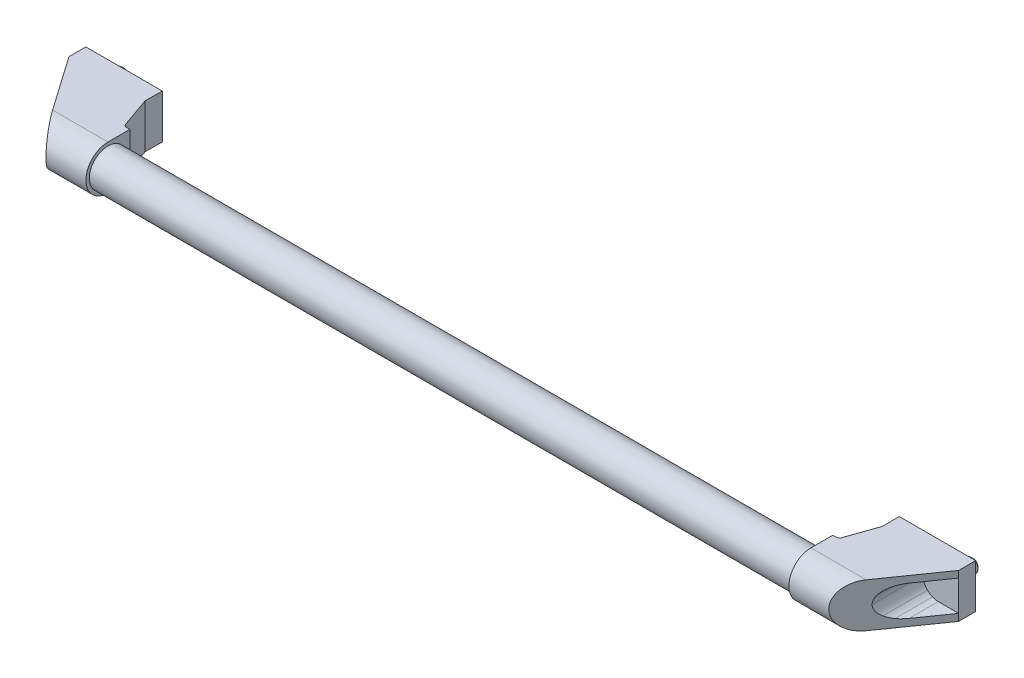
ISO-10303-21;
HEADER;
FILE_DESCRIPTION(('STEP AP214'),'2;1');
FILE_NAME('part.step','',(''),(''),'','','');
FILE_SCHEMA(('AUTOMOTIVE_DESIGN { 1 0 10303 214 1 1 1 1 }'));
ENDSEC;
DATA;
#1=APPLICATION_CONTEXT('core data for automotive mechanical design processes');
#2=APPLICATION_PROTOCOL_DEFINITION('international standard','automotive_design',2000,#1);
#3=PRODUCT_CONTEXT('',#1,'mechanical');
#4=PRODUCT('Part','Part','',(#3));
#5=PRODUCT_RELATED_PRODUCT_CATEGORY('part','',(#4));
#6=PRODUCT_DEFINITION_FORMATION('','',#4);
#7=PRODUCT_DEFINITION_CONTEXT('part definition',#1,'design');
#8=PRODUCT_DEFINITION('design','',#6,#7);
#9=PRODUCT_DEFINITION_SHAPE('','',#8);
#10=(LENGTH_UNIT() NAMED_UNIT(*) SI_UNIT(.MILLI.,.METRE.));
#11=(NAMED_UNIT(*) PLANE_ANGLE_UNIT() SI_UNIT($,.RADIAN.));
#12=(NAMED_UNIT(*) SI_UNIT($,.STERADIAN.) SOLID_ANGLE_UNIT());
#13=UNCERTAINTY_MEASURE_WITH_UNIT(LENGTH_MEASURE(1.E-05),#10,'distance_accuracy_value','');
#14=(GEOMETRIC_REPRESENTATION_CONTEXT(3) GLOBAL_UNCERTAINTY_ASSIGNED_CONTEXT((#13)) GLOBAL_UNIT_ASSIGNED_CONTEXT((#10,
#11,#12)) REPRESENTATION_CONTEXT('',''));
#15=CARTESIAN_POINT('',(0.,0.,0.));
#16=DIRECTION('',(0.,0.,1.));
#17=DIRECTION('',(1.,0.,0.));
#18=AXIS2_PLACEMENT_3D('',#15,#16,#17);
#19=CARTESIAN_POINT('',(512.,13.,-2.23779328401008E-13));
#20=DIRECTION('',(0.,0.,-1.));
#21=DIRECTION('',(-1.,0.,0.));
#22=AXIS2_PLACEMENT_3D('',#19,#20,#21);
#23=PLANE('',#22);
#24=DIRECTION('',(0.,-1.,0.));
#25=VECTOR('',#24,1.);
#26=CARTESIAN_POINT('',(487.,8.,-2.04697370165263E-13));
#27=LINE('',#26,#25);
#28=CARTESIAN_POINT('',(487.,8.,-2.04697370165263E-13));
#29=VERTEX_POINT('',#28);
#30=CARTESIAN_POINT('',(487.,-8.,-2.04697370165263E-13));
#31=VERTEX_POINT('',#30);
#32=EDGE_CURVE('E497',#29,#31,#27,.T.);
#33=ORIENTED_EDGE('',*,*,#32,.F.);
#34=DIRECTION('',(-1.,0.,0.));
#35=VECTOR('',#34,1.);
#36=CARTESIAN_POINT('',(487.,8.,-2.04697370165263E-13));
#37=LINE('',#36,#35);
#38=CARTESIAN_POINT('',(472.,8.,-1.97758476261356E-13));
#39=VERTEX_POINT('',#38);
#40=EDGE_CURVE('E30',#29,#39,#37,.T.);
#41=ORIENTED_EDGE('',*,*,#40,.T.);
#42=DIRECTION('',(0.,1.,0.));
#43=VECTOR('',#42,1.);
#44=CARTESIAN_POINT('',(472.,-8.,-1.97758476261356E-13));
#45=LINE('',#44,#43);
#46=CARTESIAN_POINT('',(472.,-8.,-1.97758476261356E-13));
#47=VERTEX_POINT('',#46);
#48=EDGE_CURVE('E491',#47,#39,#45,.T.);
#49=ORIENTED_EDGE('',*,*,#48,.F.);
#50=DIRECTION('',(1.,0.,0.));
#51=VECTOR('',#50,1.);
#52=CARTESIAN_POINT('',(472.,-8.,-1.97758476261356E-13));
#53=LINE('',#52,#51);
#54=EDGE_CURVE('E494',#47,#31,#53,.T.);
#55=ORIENTED_EDGE('',*,*,#54,.T.);
#56=EDGE_LOOP('',(#33,#41,#49,#55));
#57=FACE_BOUND('',#56,.T.);
#58=DIRECTION('',(0.,1.,0.));
#59=VECTOR('',#58,1.);
#60=CARTESIAN_POINT('',(467.,-13.,-1.95156391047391E-13));
#61=LINE('',#60,#59);
#62=CARTESIAN_POINT('',(467.,-13.,-1.95156391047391E-13));
#63=VERTEX_POINT('',#62);
#64=CARTESIAN_POINT('',(467.,13.,-1.95156391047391E-13));
#65=VERTEX_POINT('',#64);
#66=EDGE_CURVE('E595',#63,#65,#61,.T.);
#67=ORIENTED_EDGE('',*,*,#66,.T.);
#68=DIRECTION('',(-1.,0.,0.));
#69=VECTOR('',#68,1.);
#70=CARTESIAN_POINT('',(512.,13.,-2.23779328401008E-13));
#71=LINE('',#70,#69);
#72=CARTESIAN_POINT('',(512.,13.,-2.23779328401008E-13));
#73=VERTEX_POINT('',#72);
#74=EDGE_CURVE('E626',#73,#65,#71,.T.);
#75=ORIENTED_EDGE('',*,*,#74,.F.);
#76=DIRECTION('',(0.,-1.,0.));
#77=VECTOR('',#76,1.);
#78=CARTESIAN_POINT('',(512.,13.,-2.23779328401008E-13));
#79=LINE('',#78,#77);
#80=CARTESIAN_POINT('',(512.,-13.,-2.23779328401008E-13));
#81=VERTEX_POINT('',#80);
#82=EDGE_CURVE('E621',#73,#81,#79,.T.);
#83=ORIENTED_EDGE('',*,*,#82,.T.);
#84=DIRECTION('',(-1.,0.,0.));
#85=VECTOR('',#84,1.);
#86=CARTESIAN_POINT('',(512.,-13.,-2.23779328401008E-13));
#87=LINE('',#86,#85);
#88=EDGE_CURVE('E629',#81,#63,#87,.T.);
#89=ORIENTED_EDGE('',*,*,#88,.T.);
#90=EDGE_LOOP('',(#67,#75,#83,#89));
#91=FACE_BOUND('',#90,.T.);
#92=CARTESIAN_POINT('',(500.,0.,-2.16840434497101E-13));
#93=DIRECTION('',(0.,0.,1.));
#94=DIRECTION('',(1.,0.,0.));
#95=AXIS2_PLACEMENT_3D('',#92,#93,#94);
#96=CIRCLE('',#95,4.);
#97=CARTESIAN_POINT('',(504.,0.,-2.18415563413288E-13));
#98=VERTEX_POINT('',#97);
#99=EDGE_CURVE('E481',#98,#98,#96,.T.);
#100=ORIENTED_EDGE('',*,*,#99,.T.);
#101=EDGE_LOOP('',(#100));
#102=FACE_BOUND('',#101,.T.);
#103=ADVANCED_FACE('F14',(#57,#91,#102),#23,.T.);
#104=CARTESIAN_POINT('',(512.,-13.,9.99999999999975));
#105=DIRECTION('',(-0.819152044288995,0.,-0.573576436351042));
#106=DIRECTION('',(-0.573576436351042,0.,0.819152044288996));
#107=AXIS2_PLACEMENT_3D('',#104,#105,#106);
#108=PLANE('',#107);
#109=DIRECTION('',(0.573576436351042,0.,-0.819152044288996));
#110=VECTOR('',#109,1.);
#111=CARTESIAN_POINT('',(512.,-8.90119415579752,9.99999999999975));
#112=LINE('',#111,#110);
#113=CARTESIAN_POINT('',(499.999992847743,-8.90119415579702,27.1377862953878));
#114=VERTEX_POINT('',#113);
#115=CARTESIAN_POINT('',(512.,-8.90119415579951,9.99999999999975));
#116=VERTEX_POINT('',#115);
#117=EDGE_CURVE('E9',#114,#116,#112,.T.);
#118=ORIENTED_EDGE('',*,*,#117,.F.);
#119=CARTESIAN_POINT('',(499.999999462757,0.0988421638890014,27.1377768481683));
#120=DIRECTION('',(-0.819152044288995,0.,-0.573576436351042));
#121=DIRECTION('',(-0.573576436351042,0.,0.819152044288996));
#122=AXIS2_PLACEMENT_3D('',#119,#120,#121);
#123=ELLIPSE('',#122,15.6910844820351,9.00003631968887);
#124=CARTESIAN_POINT('',(496.555841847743,-8.21611015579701,32.0565436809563));
#125=VERTEX_POINT('',#124);
#126=EDGE_CURVE('E23',#114,#125,#123,.T.);
#127=ORIENTED_EDGE('',*,*,#126,.T.);
#128=CARTESIAN_POINT('',(500.00001388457,0.0988360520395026,27.1377562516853));
#129=DIRECTION('',(-0.819152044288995,0.,-0.573576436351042));
#130=DIRECTION('',(-0.573576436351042,0.,0.819152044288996));
#131=AXIS2_PLACEMENT_3D('',#128,#129,#130);
#132=ELLIPSE('',#131,15.6910842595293,9.00003619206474);
#133=CARTESIAN_POINT('',(493.636031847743,-6.26515515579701,36.2264645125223));
#134=VERTEX_POINT('',#133);
#135=EDGE_CURVE('E651',#125,#134,#132,.T.);
#136=ORIENTED_EDGE('',*,*,#135,.T.);
#137=CARTESIAN_POINT('',(500.000032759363,0.0988180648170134,27.1377292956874));
#138=DIRECTION('',(-0.819152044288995,0.,-0.573576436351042));
#139=DIRECTION('',(-0.573576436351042,0.,0.819152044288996));
#140=AXIS2_PLACEMENT_3D('',#137,#138,#139);
#141=ELLIPSE('',#140,15.6910853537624,9.00003681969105);
#142=CARTESIAN_POINT('',(490.999995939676,0.0988089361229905,39.9911139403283));
#143=VERTEX_POINT('',#142);
#144=EDGE_CURVE('E648',#134,#143,#141,.T.);
#145=ORIENTED_EDGE('',*,*,#144,.T.);
#146=CARTESIAN_POINT('',(500.000030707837,0.098790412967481,27.1377322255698));
#147=DIRECTION('',(-0.819152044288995,0.,-0.573576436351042));
#148=DIRECTION('',(-0.573576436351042,0.,0.819152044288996));
#149=AXIS2_PLACEMENT_3D('',#146,#147,#148);
#150=ELLIPSE('',#149,15.6910817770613,9.00003476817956);
#151=CARTESIAN_POINT('',(493.636039,6.4627699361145,36.2264542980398));
#152=VERTEX_POINT('',#151);
#153=EDGE_CURVE('E645',#143,#152,#150,.T.);
#154=ORIENTED_EDGE('',*,*,#153,.T.);
#155=CARTESIAN_POINT('',(500.000021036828,0.0987787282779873,27.1377460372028));
#156=DIRECTION('',(-0.819152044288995,0.,-0.573576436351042));
#157=DIRECTION('',(-0.573576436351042,0.,0.819152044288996));
#158=AXIS2_PLACEMENT_3D('',#155,#156,#157);
#159=ELLIPSE('',#158,15.6910842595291,9.00003619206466);
#160=CARTESIAN_POINT('',(496.555849,8.4137249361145,32.0565334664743));
#161=VERTEX_POINT('',#160);
#162=EDGE_CURVE('E642',#152,#161,#159,.T.);
#163=ORIENTED_EDGE('',*,*,#162,.T.);
#164=CARTESIAN_POINT('',(500.000006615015,0.098772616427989,27.1377666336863));
#165=DIRECTION('',(-0.819152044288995,0.,-0.573576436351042));
#166=DIRECTION('',(-0.573576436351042,0.,0.819152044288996));
#167=AXIS2_PLACEMENT_3D('',#164,#165,#166);
#168=ELLIPSE('',#167,15.691084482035,9.0000363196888);
#169=CARTESIAN_POINT('',(500.,9.09880893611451,27.1377760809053));
#170=VERTEX_POINT('',#169);
#171=EDGE_CURVE('E639',#161,#170,#168,.T.);
#172=ORIENTED_EDGE('',*,*,#171,.T.);
#173=DIRECTION('',(0.573576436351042,0.,-0.819152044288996));
#174=VECTOR('',#173,1.);
#175=CARTESIAN_POINT('',(512.,9.09880893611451,9.99999999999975));
#176=LINE('',#175,#174);
#177=CARTESIAN_POINT('',(512.,9.09880893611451,9.99999999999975));
#178=VERTEX_POINT('',#177);
#179=EDGE_CURVE('E636',#170,#178,#176,.T.);
#180=ORIENTED_EDGE('',*,*,#179,.T.);
#181=DIRECTION('',(0.,1.,0.));
#182=VECTOR('',#181,1.);
#183=CARTESIAN_POINT('',(512.,-13.,9.99999999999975));
#184=LINE('',#183,#182);
#185=CARTESIAN_POINT('',(512.,13.,9.99999999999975));
#186=VERTEX_POINT('',#185);
#187=EDGE_CURVE('E604',#178,#186,#184,.T.);
#188=ORIENTED_EDGE('',*,*,#187,.T.);
#189=DIRECTION('',(-0.573576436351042,0.,0.819152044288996));
#190=VECTOR('',#189,1.);
#191=CARTESIAN_POINT('',(512.,13.,9.99999999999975));
#192=LINE('',#191,#190);
#193=CARTESIAN_POINT('',(489.59335877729,13.,42.));
#194=VERTEX_POINT('',#193);
#195=EDGE_CURVE('E598',#186,#194,#192,.T.);
#196=ORIENTED_EDGE('',*,*,#195,.T.);
#197=CARTESIAN_POINT('',(489.59335877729,0.,42.));
#198=DIRECTION('',(-0.819152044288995,0.,-0.573576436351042));
#199=DIRECTION('',(-0.573576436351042,0.,0.819152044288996));
#200=AXIS2_PLACEMENT_3D('',#197,#198,#199);
#201=ELLIPSE('',#200,15.8700696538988,13.);
#202=CARTESIAN_POINT('',(489.59335877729,-13.,42.));
#203=VERTEX_POINT('',#202);
#204=EDGE_CURVE('E608',#203,#194,#201,.T.);
#205=ORIENTED_EDGE('',*,*,#204,.F.);
#206=DIRECTION('',(-0.573576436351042,0.,0.819152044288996));
#207=VECTOR('',#206,1.);
#208=CARTESIAN_POINT('',(512.,-13.,9.99999999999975));
#209=LINE('',#208,#207);
#210=CARTESIAN_POINT('',(512.,-13.,9.99999999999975));
#211=VERTEX_POINT('',#210);
#212=EDGE_CURVE('E601',#211,#203,#209,.T.);
#213=ORIENTED_EDGE('',*,*,#212,.F.);
#214=EDGE_CURVE('E605',#211,#116,#184,.T.);
#215=ORIENTED_EDGE('',*,*,#214,.T.);
#216=EDGE_LOOP('',(#118,#127,#136,#145,#154,#163,#172,#180,#188,#196,#205,#213,#215));
#217=FACE_BOUND('',#216,.T.);
#218=ADVANCED_FACE('F657',(#217),#108,.F.);
#219=CARTESIAN_POINT('',(512.,13.,42.));
#220=DIRECTION('',(0.,1.,0.));
#221=DIRECTION('',(-1.,0.,0.));
#222=AXIS2_PLACEMENT_3D('',#219,#220,#221);
#223=PLANE('',#222);
#224=DIRECTION('',(-0.0104830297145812,0.,-0.999945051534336));
#225=VECTOR('',#224,1.);
#226=CARTESIAN_POINT('',(467.104830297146,13.,9.99945051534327));
#227=LINE('',#226,#225);
#228=CARTESIAN_POINT('',(467.104830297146,13.,9.99945051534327));
#229=VERTEX_POINT('',#228);
#230=EDGE_CURVE('E573',#229,#65,#227,.T.);
#231=ORIENTED_EDGE('',*,*,#230,.F.);
#232=DIRECTION('',(-0.332150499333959,0.,0.943226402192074));
#233=VECTOR('',#232,1.);
#234=CARTESIAN_POINT('',(467.104830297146,13.,9.99945051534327));
#235=LINE('',#234,#233);
#236=CARTESIAN_POINT('',(460.854102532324,13.,27.7499927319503));
#237=VERTEX_POINT('',#236);
#238=EDGE_CURVE('E570',#229,#237,#235,.T.);
#239=ORIENTED_EDGE('',*,*,#238,.T.);
#240=CARTESIAN_POINT('',(458.967649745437,13.,27.0856916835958));
#241=DIRECTION('',(0.,1.,0.));
#242=DIRECTION('',(-1.,0.,0.));
#243=AXIS2_PLACEMENT_3D('',#240,#241,#242);
#244=CIRCLE('',#243,2.);
#245=CARTESIAN_POINT('',(458.988615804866,13.,29.0855817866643));
#246=VERTEX_POINT('',#245);
#247=EDGE_CURVE('E567',#246,#237,#244,.T.);
#248=ORIENTED_EDGE('',*,*,#247,.F.);
#249=DIRECTION('',(0.999945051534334,0.,-0.0104830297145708));
#250=VECTOR('',#249,1.);
#251=CARTESIAN_POINT('',(457.,13.,29.1064296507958));
#252=LINE('',#251,#250);
#253=CARTESIAN_POINT('',(457.,13.,29.1064296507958));
#254=VERTEX_POINT('',#253);
#255=EDGE_CURVE('E564',#254,#246,#252,.T.);
#256=ORIENTED_EDGE('',*,*,#255,.F.);
#257=DIRECTION('',(0.,0.,-1.));
#258=VECTOR('',#257,1.);
#259=CARTESIAN_POINT('',(457.,13.,42.));
#260=LINE('',#259,#258);
#261=CARTESIAN_POINT('',(457.,13.,42.));
#262=VERTEX_POINT('',#261);
#263=EDGE_CURVE('E610',#262,#254,#260,.T.);
#264=ORIENTED_EDGE('',*,*,#263,.F.);
#265=DIRECTION('',(-1.,0.,0.));
#266=VECTOR('',#265,1.);
#267=CARTESIAN_POINT('',(512.,13.,42.));
#268=LINE('',#267,#266);
#269=EDGE_CURVE('E634',#194,#262,#268,.T.);
#270=ORIENTED_EDGE('',*,*,#269,.F.);
#271=ORIENTED_EDGE('',*,*,#195,.F.);
#272=DIRECTION('',(0.,0.,-1.));
#273=VECTOR('',#272,1.);
#274=CARTESIAN_POINT('',(512.,13.,42.));
#275=LINE('',#274,#273);
#276=EDGE_CURVE('E619',#186,#73,#275,.T.);
#277=ORIENTED_EDGE('',*,*,#276,.T.);
#278=ORIENTED_EDGE('',*,*,#74,.T.);
#279=EDGE_LOOP('',(#231,#239,#248,#256,#264,#270,#271,#277,#278));
#280=FACE_BOUND('',#279,.T.);
#281=ADVANCED_FACE('F691',(#280),#223,.T.);
#282=CARTESIAN_POINT('',(512.,0.,42.));
#283=DIRECTION('',(-1.,0.,0.));
#284=DIRECTION('',(0.,-1.,0.));
#285=AXIS2_PLACEMENT_3D('',#282,#283,#284);
#286=CYLINDRICAL_SURFACE('',#285,13.);
#287=ORIENTED_EDGE('',*,*,#204,.T.);
#288=ORIENTED_EDGE('',*,*,#269,.T.);
#289=CARTESIAN_POINT('',(457.,0.,42.));
#290=DIRECTION('',(1.,0.,0.));
#291=DIRECTION('',(0.,1.,0.));
#292=AXIS2_PLACEMENT_3D('',#289,#290,#291);
#293=CIRCLE('',#292,13.);
#294=CARTESIAN_POINT('',(457.,-13.,42.));
#295=VERTEX_POINT('',#294);
#296=EDGE_CURVE('E616',#262,#295,#293,.T.);
#297=ORIENTED_EDGE('',*,*,#296,.T.);
#298=DIRECTION('',(-1.,0.,0.));
#299=VECTOR('',#298,1.);
#300=CARTESIAN_POINT('',(512.,-13.,42.));
#301=LINE('',#300,#299);
#302=EDGE_CURVE('E632',#203,#295,#301,.T.);
#303=ORIENTED_EDGE('',*,*,#302,.F.);
#304=EDGE_LOOP('',(#287,#288,#297,#303));
#305=FACE_BOUND('',#304,.T.);
#306=ADVANCED_FACE('F16',(#305),#286,.T.);
#307=CARTESIAN_POINT('',(512.,-13.,42.));
#308=DIRECTION('',(0.,1.,0.));
#309=DIRECTION('',(-1.,0.,0.));
#310=AXIS2_PLACEMENT_3D('',#307,#308,#309);
#311=PLANE('',#310);
#312=DIRECTION('',(-0.332150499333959,0.,0.943226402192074));
#313=VECTOR('',#312,1.);
#314=CARTESIAN_POINT('',(467.104830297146,-13.,9.99945051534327));
#315=LINE('',#314,#313);
#316=CARTESIAN_POINT('',(467.104830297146,-13.,9.99945051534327));
#317=VERTEX_POINT('',#316);
#318=CARTESIAN_POINT('',(460.854102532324,-13.,27.7499927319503));
#319=VERTEX_POINT('',#318);
#320=EDGE_CURVE('E581',#317,#319,#315,.T.);
#321=ORIENTED_EDGE('',*,*,#320,.F.);
#322=DIRECTION('',(-0.0104830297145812,0.,-0.999945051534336));
#323=VECTOR('',#322,1.);
#324=CARTESIAN_POINT('',(467.104830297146,-13.,9.99945051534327));
#325=LINE('',#324,#323);
#326=EDGE_CURVE('E584',#317,#63,#325,.T.);
#327=ORIENTED_EDGE('',*,*,#326,.T.);
#328=ORIENTED_EDGE('',*,*,#88,.F.);
#329=DIRECTION('',(0.,0.,-1.));
#330=VECTOR('',#329,1.);
#331=CARTESIAN_POINT('',(512.,-13.,42.));
#332=LINE('',#331,#330);
#333=EDGE_CURVE('E624',#211,#81,#332,.T.);
#334=ORIENTED_EDGE('',*,*,#333,.F.);
#335=ORIENTED_EDGE('',*,*,#212,.T.);
#336=ORIENTED_EDGE('',*,*,#302,.T.);
#337=DIRECTION('',(0.,0.,-1.));
#338=VECTOR('',#337,1.);
#339=CARTESIAN_POINT('',(457.,-13.,42.));
#340=LINE('',#339,#338);
#341=CARTESIAN_POINT('',(457.,-13.,29.1064296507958));
#342=VERTEX_POINT('',#341);
#343=EDGE_CURVE('E613',#295,#342,#340,.T.);
#344=ORIENTED_EDGE('',*,*,#343,.T.);
#345=DIRECTION('',(0.999945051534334,0.,-0.0104830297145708));
#346=VECTOR('',#345,1.);
#347=CARTESIAN_POINT('',(457.,-13.,29.1064296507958));
#348=LINE('',#347,#346);
#349=CARTESIAN_POINT('',(458.988615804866,-13.,29.0855817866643));
#350=VERTEX_POINT('',#349);
#351=EDGE_CURVE('E575',#342,#350,#348,.T.);
#352=ORIENTED_EDGE('',*,*,#351,.T.);
#353=CARTESIAN_POINT('',(458.967649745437,-13.,27.0856916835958));
#354=DIRECTION('',(0.,1.,0.));
#355=DIRECTION('',(-1.,0.,0.));
#356=AXIS2_PLACEMENT_3D('',#353,#354,#355);
#357=CIRCLE('',#356,2.);
#358=EDGE_CURVE('E578',#350,#319,#357,.T.);
#359=ORIENTED_EDGE('',*,*,#358,.T.);
#360=EDGE_LOOP('',(#321,#327,#328,#334,#335,#336,#344,#352,#359));
#361=FACE_BOUND('',#360,.T.);
#362=ADVANCED_FACE('F701',(#361),#311,.F.);
#363=CARTESIAN_POINT('',(512.,0.,42.));
#364=DIRECTION('',(1.,0.,0.));
#365=DIRECTION('',(0.,1.,0.));
#366=AXIS2_PLACEMENT_3D('',#363,#364,#365);
#367=PLANE('',#366);
#368=ORIENTED_EDGE('',*,*,#214,.F.);
#369=ORIENTED_EDGE('',*,*,#333,.T.);
#370=ORIENTED_EDGE('',*,*,#82,.F.);
#371=ORIENTED_EDGE('',*,*,#276,.F.);
#372=ORIENTED_EDGE('',*,*,#187,.F.);
#373=DIRECTION('',(0.,1.,0.));
#374=VECTOR('',#373,1.);
#375=CARTESIAN_POINT('',(512.,-8.90119415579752,9.99999999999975));
#376=LINE('',#375,#374);
#377=EDGE_CURVE('E541',#116,#178,#376,.T.);
#378=ORIENTED_EDGE('',*,*,#377,.F.);
#379=EDGE_LOOP('',(#368,#369,#370,#371,#372,#378));
#380=FACE_BOUND('',#379,.T.);
#381=ADVANCED_FACE('F686',(#380),#367,.T.);
#382=CARTESIAN_POINT('',(457.,0.,42.));
#383=DIRECTION('',(1.,0.,0.));
#384=DIRECTION('',(0.,1.,0.));
#385=AXIS2_PLACEMENT_3D('',#382,#383,#384);
#386=PLANE('',#385);
#387=CARTESIAN_POINT('',(457.,0.,42.));
#388=DIRECTION('',(1.,0.,0.));
#389=DIRECTION('',(0.,1.,0.));
#390=AXIS2_PLACEMENT_3D('',#387,#388,#389);
#391=CIRCLE('',#390,11.);
#392=CARTESIAN_POINT('',(457.,11.,42.));
#393=VERTEX_POINT('',#392);
#394=EDGE_CURVE('E18',#393,#393,#391,.T.);
#395=ORIENTED_EDGE('',*,*,#394,.T.);
#396=EDGE_LOOP('',(#395));
#397=FACE_BOUND('',#396,.T.);
#398=ORIENTED_EDGE('',*,*,#263,.T.);
#399=DIRECTION('',(0.,1.,0.));
#400=VECTOR('',#399,1.);
#401=CARTESIAN_POINT('',(457.,-13.,29.1064296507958));
#402=LINE('',#401,#400);
#403=EDGE_CURVE('E587',#342,#254,#402,.T.);
#404=ORIENTED_EDGE('',*,*,#403,.F.);
#405=ORIENTED_EDGE('',*,*,#343,.F.);
#406=ORIENTED_EDGE('',*,*,#296,.F.);
#407=EDGE_LOOP('',(#398,#404,#405,#406));
#408=FACE_BOUND('',#407,.T.);
#409=ADVANCED_FACE('F717',(#397,#408),#386,.F.);
#410=CARTESIAN_POINT('',(467.104830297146,-13.,9.99945051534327));
#411=DIRECTION('',(0.999945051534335,0.,-0.0104830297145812));
#412=DIRECTION('',(-0.0104830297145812,0.,-0.999945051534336));
#413=AXIS2_PLACEMENT_3D('',#410,#411,#412);
#414=PLANE('',#413);
#415=DIRECTION('',(0.,1.,0.));
#416=VECTOR('',#415,1.);
#417=CARTESIAN_POINT('',(467.104830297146,-13.,9.99945051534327));
#418=LINE('',#417,#416);
#419=EDGE_CURVE('E593',#317,#229,#418,.T.);
#420=ORIENTED_EDGE('',*,*,#419,.T.);
#421=ORIENTED_EDGE('',*,*,#230,.T.);
#422=ORIENTED_EDGE('',*,*,#66,.F.);
#423=ORIENTED_EDGE('',*,*,#326,.F.);
#424=EDGE_LOOP('',(#420,#421,#422,#423));
#425=FACE_BOUND('',#424,.T.);
#426=ADVANCED_FACE('F698',(#425),#414,.F.);
#427=CARTESIAN_POINT('',(467.104830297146,-13.,9.99945051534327));
#428=DIRECTION('',(-0.943226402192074,0.,-0.332150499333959));
#429=DIRECTION('',(-0.332150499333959,0.,0.943226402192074));
#430=AXIS2_PLACEMENT_3D('',#427,#428,#429);
#431=PLANE('',#430);
#432=DIRECTION('',(0.,1.,0.));
#433=VECTOR('',#432,1.);
#434=CARTESIAN_POINT('',(460.854102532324,-13.,27.7499927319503));
#435=LINE('',#434,#433);
#436=EDGE_CURVE('E591',#319,#237,#435,.T.);
#437=ORIENTED_EDGE('',*,*,#436,.T.);
#438=ORIENTED_EDGE('',*,*,#238,.F.);
#439=ORIENTED_EDGE('',*,*,#419,.F.);
#440=ORIENTED_EDGE('',*,*,#320,.T.);
#441=EDGE_LOOP('',(#437,#438,#439,#440));
#442=FACE_BOUND('',#441,.T.);
#443=ADVANCED_FACE('F705',(#442),#431,.T.);
#444=CARTESIAN_POINT('',(458.967649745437,-13.,27.0856916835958));
#445=DIRECTION('',(0.,1.,0.));
#446=DIRECTION('',(-1.,0.,0.));
#447=AXIS2_PLACEMENT_3D('',#444,#445,#446);
#448=CYLINDRICAL_SURFACE('',#447,2.);
#449=DIRECTION('',(0.,1.,0.));
#450=VECTOR('',#449,1.);
#451=CARTESIAN_POINT('',(458.988615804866,-13.,29.0855817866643));
#452=LINE('',#451,#450);
#453=EDGE_CURVE('E589',#350,#246,#452,.T.);
#454=ORIENTED_EDGE('',*,*,#453,.T.);
#455=ORIENTED_EDGE('',*,*,#247,.T.);
#456=ORIENTED_EDGE('',*,*,#436,.F.);
#457=ORIENTED_EDGE('',*,*,#358,.F.);
#458=EDGE_LOOP('',(#454,#455,#456,#457));
#459=FACE_BOUND('',#458,.T.);
#460=ADVANCED_FACE('F711',(#459),#448,.F.);
#461=CARTESIAN_POINT('',(457.,-13.,29.1064296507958));
#462=DIRECTION('',(0.0104830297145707,0.,0.999945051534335));
#463=DIRECTION('',(0.999945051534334,0.,-0.0104830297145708));
#464=AXIS2_PLACEMENT_3D('',#461,#462,#463);
#465=PLANE('',#464);
#466=ORIENTED_EDGE('',*,*,#403,.T.);
#467=ORIENTED_EDGE('',*,*,#255,.T.);
#468=ORIENTED_EDGE('',*,*,#453,.F.);
#469=ORIENTED_EDGE('',*,*,#351,.F.);
#470=EDGE_LOOP('',(#466,#467,#468,#469));
#471=FACE_BOUND('',#470,.T.);
#472=ADVANCED_FACE('F713',(#471),#465,.F.);
#473=CARTESIAN_POINT('',(512.,-8.90119415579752,9.99999999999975));
#474=DIRECTION('',(0.,1.,0.));
#475=DIRECTION('',(-1.,0.,0.));
#476=AXIS2_PLACEMENT_3D('',#473,#474,#475);
#477=PLANE('',#476);
#478=ORIENTED_EDGE('',*,*,#117,.T.);
#479=DIRECTION('',(-1.,0.,0.));
#480=VECTOR('',#479,1.);
#481=CARTESIAN_POINT('',(512.,-8.90119415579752,9.99999999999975));
#482=LINE('',#481,#480);
#483=CARTESIAN_POINT('',(499.999992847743,-8.90119415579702,9.99999999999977));
#484=VERTEX_POINT('',#483);
#485=EDGE_CURVE('E38',#116,#484,#482,.T.);
#486=ORIENTED_EDGE('',*,*,#485,.T.);
#487=DIRECTION('',(0.,0.,1.));
#488=VECTOR('',#487,1.);
#489=CARTESIAN_POINT('',(499.999992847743,-8.90119415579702,9.99999999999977));
#490=LINE('',#489,#488);
#491=EDGE_CURVE('E561',#484,#114,#490,.T.);
#492=ORIENTED_EDGE('',*,*,#491,.T.);
#493=EDGE_LOOP('',(#478,#486,#492));
#494=FACE_BOUND('',#493,.T.);
#495=ADVANCED_FACE('F662',(#494),#477,.T.);
#496=CARTESIAN_POINT('',(499.999999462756,0.0988421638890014,9.99999999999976));
#497=DIRECTION('',(0.,0.,1.));
#498=DIRECTION('',(1.,0.,0.));
#499=AXIS2_PLACEMENT_3D('',#496,#497,#498);
#500=CYLINDRICAL_SURFACE('',#499,9.00003631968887);
#501=ORIENTED_EDGE('',*,*,#491,.F.);
#502=CARTESIAN_POINT('',(499.999999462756,0.0988421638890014,9.99999999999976));
#503=DIRECTION('',(0.,0.,1.));
#504=DIRECTION('',(1.,0.,0.));
#505=AXIS2_PLACEMENT_3D('',#502,#503,#504);
#506=CIRCLE('',#505,9.00003631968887);
#507=CARTESIAN_POINT('',(496.555841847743,-8.21611015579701,9.99999999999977));
#508=VERTEX_POINT('',#507);
#509=EDGE_CURVE('E521',#508,#484,#506,.T.);
#510=ORIENTED_EDGE('',*,*,#509,.F.);
#511=DIRECTION('',(0.,0.,1.));
#512=VECTOR('',#511,1.);
#513=CARTESIAN_POINT('',(496.555841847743,-8.21611015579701,9.99999999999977));
#514=LINE('',#513,#512);
#515=EDGE_CURVE('E558',#508,#125,#514,.T.);
#516=ORIENTED_EDGE('',*,*,#515,.T.);
#517=ORIENTED_EDGE('',*,*,#126,.F.);
#518=EDGE_LOOP('',(#501,#510,#516,#517));
#519=FACE_BOUND('',#518,.T.);
#520=ADVANCED_FACE('F659',(#519),#500,.F.);
#521=CARTESIAN_POINT('',(500.00001388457,0.0988360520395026,9.99999999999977));
#522=DIRECTION('',(0.,0.,1.));
#523=DIRECTION('',(1.,0.,0.));
#524=AXIS2_PLACEMENT_3D('',#521,#522,#523);
#525=CYLINDRICAL_SURFACE('',#524,9.00003619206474);
#526=ORIENTED_EDGE('',*,*,#515,.F.);
#527=CARTESIAN_POINT('',(500.00001388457,0.0988360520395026,9.99999999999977));
#528=DIRECTION('',(0.,0.,1.));
#529=DIRECTION('',(1.,0.,0.));
#530=AXIS2_PLACEMENT_3D('',#527,#528,#529);
#531=CIRCLE('',#530,9.00003619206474);
#532=CARTESIAN_POINT('',(493.636031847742,-6.26515515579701,9.99999999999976));
#533=VERTEX_POINT('',#532);
#534=EDGE_CURVE('E523',#533,#508,#531,.T.);
#535=ORIENTED_EDGE('',*,*,#534,.F.);
#536=DIRECTION('',(0.,0.,1.));
#537=VECTOR('',#536,1.);
#538=CARTESIAN_POINT('',(493.636031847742,-6.26515515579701,9.99999999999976));
#539=LINE('',#538,#537);
#540=EDGE_CURVE('E555',#533,#134,#539,.T.);
#541=ORIENTED_EDGE('',*,*,#540,.T.);
#542=ORIENTED_EDGE('',*,*,#135,.F.);
#543=EDGE_LOOP('',(#526,#535,#541,#542));
#544=FACE_BOUND('',#543,.T.);
#545=ADVANCED_FACE('F667',(#544),#525,.F.);
#546=CARTESIAN_POINT('',(500.000032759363,0.0988180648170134,9.99999999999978));
#547=DIRECTION('',(0.,0.,1.));
#548=DIRECTION('',(1.,0.,0.));
#549=AXIS2_PLACEMENT_3D('',#546,#547,#548);
#550=CYLINDRICAL_SURFACE('',#549,9.00003681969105);
#551=ORIENTED_EDGE('',*,*,#540,.F.);
#552=CARTESIAN_POINT('',(500.000032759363,0.0988180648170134,9.99999999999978));
#553=DIRECTION('',(0.,0.,1.));
#554=DIRECTION('',(1.,0.,0.));
#555=AXIS2_PLACEMENT_3D('',#552,#553,#554);
#556=CIRCLE('',#555,9.00003681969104);
#557=CARTESIAN_POINT('',(490.999995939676,0.0988089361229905,9.99999999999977));
#558=VERTEX_POINT('',#557);
#559=EDGE_CURVE('E526',#558,#533,#556,.T.);
#560=ORIENTED_EDGE('',*,*,#559,.F.);
#561=DIRECTION('',(0.,0.,1.));
#562=VECTOR('',#561,1.);
#563=CARTESIAN_POINT('',(490.999995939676,0.0988089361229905,9.99999999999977));
#564=LINE('',#563,#562);
#565=EDGE_CURVE('E552',#558,#143,#564,.T.);
#566=ORIENTED_EDGE('',*,*,#565,.T.);
#567=ORIENTED_EDGE('',*,*,#144,.F.);
#568=EDGE_LOOP('',(#551,#560,#566,#567));
#569=FACE_BOUND('',#568,.T.);
#570=ADVANCED_FACE('F669',(#569),#550,.F.);
#571=CARTESIAN_POINT('',(500.000030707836,0.098790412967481,9.99999999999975));
#572=DIRECTION('',(0.,0.,1.));
#573=DIRECTION('',(1.,0.,0.));
#574=AXIS2_PLACEMENT_3D('',#571,#572,#573);
#575=CYLINDRICAL_SURFACE('',#574,9.00003476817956);
#576=ORIENTED_EDGE('',*,*,#565,.F.);
#577=CARTESIAN_POINT('',(500.000030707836,0.098790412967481,9.99999999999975));
#578=DIRECTION('',(0.,0.,1.));
#579=DIRECTION('',(1.,0.,0.));
#580=AXIS2_PLACEMENT_3D('',#577,#578,#579);
#581=CIRCLE('',#580,9.00003476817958);
#582=CARTESIAN_POINT('',(493.636039,6.4627699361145,9.99999999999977));
#583=VERTEX_POINT('',#582);
#584=EDGE_CURVE('E529',#583,#558,#581,.T.);
#585=ORIENTED_EDGE('',*,*,#584,.F.);
#586=DIRECTION('',(0.,0.,1.));
#587=VECTOR('',#586,1.);
#588=CARTESIAN_POINT('',(493.636039,6.4627699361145,9.99999999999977));
#589=LINE('',#588,#587);
#590=EDGE_CURVE('E549',#583,#152,#589,.T.);
#591=ORIENTED_EDGE('',*,*,#590,.T.);
#592=ORIENTED_EDGE('',*,*,#153,.F.);
#593=EDGE_LOOP('',(#576,#585,#591,#592));
#594=FACE_BOUND('',#593,.T.);
#595=ADVANCED_FACE('F672',(#594),#575,.F.);
#596=CARTESIAN_POINT('',(500.000021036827,0.0987787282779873,9.99999999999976));
#597=DIRECTION('',(0.,0.,1.));
#598=DIRECTION('',(1.,0.,0.));
#599=AXIS2_PLACEMENT_3D('',#596,#597,#598);
#600=CYLINDRICAL_SURFACE('',#599,9.00003619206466);
#601=ORIENTED_EDGE('',*,*,#590,.F.);
#602=CARTESIAN_POINT('',(500.000021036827,0.0987787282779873,9.99999999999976));
#603=DIRECTION('',(0.,0.,1.));
#604=DIRECTION('',(1.,0.,0.));
#605=AXIS2_PLACEMENT_3D('',#602,#603,#604);
#606=CIRCLE('',#605,9.00003619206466);
#607=CARTESIAN_POINT('',(496.555849,8.4137249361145,9.99999999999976));
#608=VERTEX_POINT('',#607);
#609=EDGE_CURVE('E532',#608,#583,#606,.T.);
#610=ORIENTED_EDGE('',*,*,#609,.F.);
#611=DIRECTION('',(0.,0.,1.));
#612=VECTOR('',#611,1.);
#613=CARTESIAN_POINT('',(496.555849,8.4137249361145,9.99999999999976));
#614=LINE('',#613,#612);
#615=EDGE_CURVE('E546',#608,#161,#614,.T.);
#616=ORIENTED_EDGE('',*,*,#615,.T.);
#617=ORIENTED_EDGE('',*,*,#162,.F.);
#618=EDGE_LOOP('',(#601,#610,#616,#617));
#619=FACE_BOUND('',#618,.T.);
#620=ADVANCED_FACE('F676',(#619),#600,.F.);
#621=CARTESIAN_POINT('',(500.000006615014,0.098772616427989,9.99999999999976));
#622=DIRECTION('',(0.,0.,1.));
#623=DIRECTION('',(1.,0.,0.));
#624=AXIS2_PLACEMENT_3D('',#621,#622,#623);
#625=CYLINDRICAL_SURFACE('',#624,9.0000363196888);
#626=ORIENTED_EDGE('',*,*,#615,.F.);
#627=CARTESIAN_POINT('',(500.000006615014,0.098772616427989,9.99999999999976));
#628=DIRECTION('',(0.,0.,1.));
#629=DIRECTION('',(1.,0.,0.));
#630=AXIS2_PLACEMENT_3D('',#627,#628,#629);
#631=CIRCLE('',#630,9.0000363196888);
#632=CARTESIAN_POINT('',(500.,9.09880893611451,9.99999999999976));
#633=VERTEX_POINT('',#632);
#634=EDGE_CURVE('E535',#633,#608,#631,.T.);
#635=ORIENTED_EDGE('',*,*,#634,.F.);
#636=DIRECTION('',(0.,0.,1.));
#637=VECTOR('',#636,1.);
#638=CARTESIAN_POINT('',(500.,9.09880893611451,9.99999999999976));
#639=LINE('',#638,#637);
#640=EDGE_CURVE('E543',#633,#170,#639,.T.);
#641=ORIENTED_EDGE('',*,*,#640,.T.);
#642=ORIENTED_EDGE('',*,*,#171,.F.);
#643=EDGE_LOOP('',(#626,#635,#641,#642));
#644=FACE_BOUND('',#643,.T.);
#645=ADVANCED_FACE('F679',(#644),#625,.F.);
#646=CARTESIAN_POINT('',(512.,9.09880893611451,9.99999999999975));
#647=DIRECTION('',(0.,1.,0.));
#648=DIRECTION('',(-1.,0.,0.));
#649=AXIS2_PLACEMENT_3D('',#646,#647,#648);
#650=PLANE('',#649);
#651=ORIENTED_EDGE('',*,*,#640,.F.);
#652=DIRECTION('',(-1.,0.,0.));
#653=VECTOR('',#652,1.);
#654=CARTESIAN_POINT('',(512.,9.09880893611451,9.99999999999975));
#655=LINE('',#654,#653);
#656=EDGE_CURVE('E538',#178,#633,#655,.T.);
#657=ORIENTED_EDGE('',*,*,#656,.F.);
#658=ORIENTED_EDGE('',*,*,#179,.F.);
#659=EDGE_LOOP('',(#651,#657,#658));
#660=FACE_BOUND('',#659,.T.);
#661=ADVANCED_FACE('F764',(#660),#650,.F.);
#662=CARTESIAN_POINT('',(499.999999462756,0.0988421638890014,9.99999999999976));
#663=DIRECTION('',(0.,0.,1.));
#664=DIRECTION('',(1.,0.,0.));
#665=AXIS2_PLACEMENT_3D('',#662,#663,#664);
#666=PLANE('',#665);
#667=ORIENTED_EDGE('',*,*,#485,.F.);
#668=ORIENTED_EDGE('',*,*,#377,.T.);
#669=ORIENTED_EDGE('',*,*,#656,.T.);
#670=ORIENTED_EDGE('',*,*,#634,.T.);
#671=ORIENTED_EDGE('',*,*,#609,.T.);
#672=ORIENTED_EDGE('',*,*,#584,.T.);
#673=ORIENTED_EDGE('',*,*,#559,.T.);
#674=ORIENTED_EDGE('',*,*,#534,.T.);
#675=ORIENTED_EDGE('',*,*,#509,.T.);
#676=EDGE_LOOP('',(#667,#668,#669,#670,#671,#672,#673,#674,#675));
#677=FACE_BOUND('',#676,.T.);
#678=ADVANCED_FACE('F664',(#677),#666,.T.);
#679=CARTESIAN_POINT('',(487.,8.,30.));
#680=DIRECTION('',(0.,-1.,0.));
#681=DIRECTION('',(1.,0.,0.));
#682=AXIS2_PLACEMENT_3D('',#679,#680,#681);
#683=PLANE('',#682);
#684=DIRECTION('',(0.,0.,-1.));
#685=VECTOR('',#684,1.);
#686=CARTESIAN_POINT('',(472.,8.,30.));
#687=LINE('',#686,#685);
#688=CARTESIAN_POINT('',(472.,8.,30.));
#689=VERTEX_POINT('',#688);
#690=EDGE_CURVE('E518',#689,#39,#687,.T.);
#691=ORIENTED_EDGE('',*,*,#690,.T.);
#692=ORIENTED_EDGE('',*,*,#40,.F.);
#693=DIRECTION('',(0.,0.,-1.));
#694=VECTOR('',#693,1.);
#695=CARTESIAN_POINT('',(487.,8.,30.));
#696=LINE('',#695,#694);
#697=CARTESIAN_POINT('',(487.,8.,30.));
#698=VERTEX_POINT('',#697);
#699=EDGE_CURVE('E512',#698,#29,#696,.T.);
#700=ORIENTED_EDGE('',*,*,#699,.F.);
#701=DIRECTION('',(-1.,0.,0.));
#702=VECTOR('',#701,1.);
#703=CARTESIAN_POINT('',(487.,8.,30.));
#704=LINE('',#703,#702);
#705=EDGE_CURVE('E500',#698,#689,#704,.T.);
#706=ORIENTED_EDGE('',*,*,#705,.T.);
#707=EDGE_LOOP('',(#691,#692,#700,#706));
#708=FACE_BOUND('',#707,.T.);
#709=ADVANCED_FACE('F771',(#708),#683,.T.);
#710=CARTESIAN_POINT('',(472.,-8.,30.));
#711=DIRECTION('',(-1.,0.,0.));
#712=DIRECTION('',(0.,-1.,0.));
#713=AXIS2_PLACEMENT_3D('',#710,#711,#712);
#714=PLANE('',#713);
#715=DIRECTION('',(0.,0.,-1.));
#716=VECTOR('',#715,1.);
#717=CARTESIAN_POINT('',(472.,-8.,30.));
#718=LINE('',#717,#716);
#719=CARTESIAN_POINT('',(472.,-8.,30.));
#720=VERTEX_POINT('',#719);
#721=EDGE_CURVE('E516',#720,#47,#718,.T.);
#722=ORIENTED_EDGE('',*,*,#721,.T.);
#723=ORIENTED_EDGE('',*,*,#48,.T.);
#724=ORIENTED_EDGE('',*,*,#690,.F.);
#725=DIRECTION('',(0.,1.,0.));
#726=VECTOR('',#725,1.);
#727=CARTESIAN_POINT('',(472.,-8.,30.));
#728=LINE('',#727,#726);
#729=EDGE_CURVE('E503',#720,#689,#728,.T.);
#730=ORIENTED_EDGE('',*,*,#729,.F.);
#731=EDGE_LOOP('',(#722,#723,#724,#730));
#732=FACE_BOUND('',#731,.T.);
#733=ADVANCED_FACE('F772',(#732),#714,.F.);
#734=CARTESIAN_POINT('',(472.,-8.,30.));
#735=DIRECTION('',(0.,1.,0.));
#736=DIRECTION('',(-1.,0.,0.));
#737=AXIS2_PLACEMENT_3D('',#734,#735,#736);
#738=PLANE('',#737);
#739=DIRECTION('',(0.,0.,-1.));
#740=VECTOR('',#739,1.);
#741=CARTESIAN_POINT('',(487.,-8.,30.));
#742=LINE('',#741,#740);
#743=CARTESIAN_POINT('',(487.,-8.,30.));
#744=VERTEX_POINT('',#743);
#745=EDGE_CURVE('E514',#744,#31,#742,.T.);
#746=ORIENTED_EDGE('',*,*,#745,.T.);
#747=ORIENTED_EDGE('',*,*,#54,.F.);
#748=ORIENTED_EDGE('',*,*,#721,.F.);
#749=DIRECTION('',(1.,0.,0.));
#750=VECTOR('',#749,1.);
#751=CARTESIAN_POINT('',(472.,-8.,30.));
#752=LINE('',#751,#750);
#753=EDGE_CURVE('E506',#720,#744,#752,.T.);
#754=ORIENTED_EDGE('',*,*,#753,.T.);
#755=EDGE_LOOP('',(#746,#747,#748,#754));
#756=FACE_BOUND('',#755,.T.);
#757=ADVANCED_FACE('F775',(#756),#738,.T.);
#758=CARTESIAN_POINT('',(487.,8.,30.));
#759=DIRECTION('',(1.,0.,0.));
#760=DIRECTION('',(0.,1.,0.));
#761=AXIS2_PLACEMENT_3D('',#758,#759,#760);
#762=PLANE('',#761);
#763=DIRECTION('',(0.,-1.,0.));
#764=VECTOR('',#763,1.);
#765=CARTESIAN_POINT('',(487.,8.,30.));
#766=LINE('',#765,#764);
#767=EDGE_CURVE('E509',#698,#744,#766,.T.);
#768=ORIENTED_EDGE('',*,*,#767,.F.);
#769=ORIENTED_EDGE('',*,*,#699,.T.);
#770=ORIENTED_EDGE('',*,*,#32,.T.);
#771=ORIENTED_EDGE('',*,*,#745,.F.);
#772=EDGE_LOOP('',(#768,#769,#770,#771));
#773=FACE_BOUND('',#772,.T.);
#774=ADVANCED_FACE('F779',(#773),#762,.F.);
#775=CARTESIAN_POINT('',(472.,8.,30.));
#776=DIRECTION('',(0.,0.,-1.));
#777=DIRECTION('',(-1.,0.,0.));
#778=AXIS2_PLACEMENT_3D('',#775,#776,#777);
#779=PLANE('',#778);
#780=ORIENTED_EDGE('',*,*,#705,.F.);
#781=ORIENTED_EDGE('',*,*,#767,.T.);
#782=ORIENTED_EDGE('',*,*,#753,.F.);
#783=ORIENTED_EDGE('',*,*,#729,.T.);
#784=EDGE_LOOP('',(#780,#781,#782,#783));
#785=FACE_BOUND('',#784,.T.);
#786=ADVANCED_FACE('F781',(#785),#779,.T.);
#787=CARTESIAN_POINT('',(500.,0.,-10.6000000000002));
#788=DIRECTION('',(0.,0.,1.));
#789=DIRECTION('',(1.,0.,0.));
#790=AXIS2_PLACEMENT_3D('',#787,#788,#789);
#791=PLANE('',#790);
#792=CARTESIAN_POINT('',(500.,0.,-10.6000000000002));
#793=DIRECTION('',(0.,0.,1.));
#794=DIRECTION('',(1.,0.,0.));
#795=AXIS2_PLACEMENT_3D('',#792,#793,#794);
#796=CIRCLE('',#795,2.8);
#797=CARTESIAN_POINT('',(502.8,0.,-10.6000000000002));
#798=VERTEX_POINT('',#797);
#799=EDGE_CURVE('E487',#798,#798,#796,.T.);
#800=ORIENTED_EDGE('',*,*,#799,.F.);
#801=EDGE_LOOP('',(#800));
#802=FACE_BOUND('',#801,.T.);
#803=ADVANCED_FACE('F785',(#802),#791,.F.);
#804=CARTESIAN_POINT('',(500.,0.,-10.6000000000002));
#805=DIRECTION('',(0.,0.,1.));
#806=DIRECTION('',(1.,0.,0.));
#807=AXIS2_PLACEMENT_3D('',#804,#805,#806);
#808=CONICAL_SURFACE('',#807,2.8,0.785398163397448);
#809=CARTESIAN_POINT('',(500.,0.,-9.40000000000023));
#810=DIRECTION('',(0.,0.,1.));
#811=DIRECTION('',(1.,0.,0.));
#812=AXIS2_PLACEMENT_3D('',#809,#810,#811);
#813=CIRCLE('',#812,4.);
#814=CARTESIAN_POINT('',(504.,0.,-9.40000000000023));
#815=VERTEX_POINT('',#814);
#816=EDGE_CURVE('E484',#815,#815,#813,.T.);
#817=ORIENTED_EDGE('',*,*,#816,.F.);
#818=EDGE_LOOP('',(#817));
#819=FACE_BOUND('',#818,.T.);
#820=ORIENTED_EDGE('',*,*,#799,.T.);
#821=EDGE_LOOP('',(#820));
#822=FACE_BOUND('',#821,.T.);
#823=ADVANCED_FACE('F793',(#819,#822),#808,.T.);
#824=CARTESIAN_POINT('',(500.,0.,27.1377760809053));
#825=DIRECTION('',(0.,0.,1.));
#826=DIRECTION('',(1.,0.,0.));
#827=AXIS2_PLACEMENT_3D('',#824,#825,#826);
#828=CYLINDRICAL_SURFACE('',#827,4.);
#829=ORIENTED_EDGE('',*,*,#816,.T.);
#830=EDGE_LOOP('',(#829));
#831=FACE_BOUND('',#830,.T.);
#832=ORIENTED_EDGE('',*,*,#99,.F.);
#833=EDGE_LOOP('',(#832));
#834=FACE_BOUND('',#833,.T.);
#835=ADVANCED_FACE('F797',(#831,#834),#828,.T.);
#836=CARTESIAN_POINT('',(496.555841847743,0.,42.));
#837=DIRECTION('',(1.,0.,0.));
#838=DIRECTION('',(0.,0.,-1.));
#839=AXIS2_PLACEMENT_3D('',#836,#837,#838);
#840=CYLINDRICAL_SURFACE('',#839,11.);
#841=ORIENTED_EDGE('',*,*,#394,.F.);
#842=EDGE_LOOP('',(#841));
#843=FACE_BOUND('',#842,.T.);
#844=CARTESIAN_POINT('',(43.,0.,42.));
#845=DIRECTION('',(1.,0.,0.));
#846=DIRECTION('',(0.,1.,0.));
#847=AXIS2_PLACEMENT_3D('',#844,#845,#846);
#848=CIRCLE('',#847,11.);
#849=CARTESIAN_POINT('',(43.,11.,42.));
#850=VERTEX_POINT('',#849);
#851=EDGE_CURVE('E477',#850,#850,#848,.T.);
#852=ORIENTED_EDGE('',*,*,#851,.T.);
#853=EDGE_LOOP('',(#852));
#854=FACE_BOUND('',#853,.T.);
#855=ADVANCED_FACE('F801',(#843,#854),#840,.T.);
#856=CARTESIAN_POINT('',(-12.,13.,0.));
#857=DIRECTION('',(0.,0.,-1.));
#858=DIRECTION('',(1.,0.,0.));
#859=AXIS2_PLACEMENT_3D('',#856,#857,#858);
#860=PLANE('',#859);
#861=DIRECTION('',(0.,-1.,0.));
#862=VECTOR('',#861,1.);
#863=CARTESIAN_POINT('',(13.,8.,0.));
#864=LINE('',#863,#862);
#865=CARTESIAN_POINT('',(13.,8.,0.));
#866=VERTEX_POINT('',#865);
#867=CARTESIAN_POINT('',(13.,-8.,0.));
#868=VERTEX_POINT('',#867);
#869=EDGE_CURVE('E319',#866,#868,#864,.T.);
#870=ORIENTED_EDGE('',*,*,#869,.T.);
#871=DIRECTION('',(-1.,0.,0.));
#872=VECTOR('',#871,1.);
#873=CARTESIAN_POINT('',(28.,-8.,0.));
#874=LINE('',#873,#872);
#875=CARTESIAN_POINT('',(28.,-8.,0.));
#876=VERTEX_POINT('',#875);
#877=EDGE_CURVE('E306',#876,#868,#874,.T.);
#878=ORIENTED_EDGE('',*,*,#877,.F.);
#879=DIRECTION('',(0.,1.,0.));
#880=VECTOR('',#879,1.);
#881=CARTESIAN_POINT('',(28.,-8.,0.));
#882=LINE('',#881,#880);
#883=CARTESIAN_POINT('',(28.,8.,0.));
#884=VERTEX_POINT('',#883);
#885=EDGE_CURVE('E288',#876,#884,#882,.T.);
#886=ORIENTED_EDGE('',*,*,#885,.T.);
#887=DIRECTION('',(1.,0.,0.));
#888=VECTOR('',#887,1.);
#889=CARTESIAN_POINT('',(13.,8.,0.));
#890=LINE('',#889,#888);
#891=EDGE_CURVE('E303',#866,#884,#890,.T.);
#892=ORIENTED_EDGE('',*,*,#891,.F.);
#893=EDGE_LOOP('',(#870,#878,#886,#892));
#894=FACE_BOUND('',#893,.T.);
#895=DIRECTION('',(0.,1.,0.));
#896=VECTOR('',#895,1.);
#897=CARTESIAN_POINT('',(33.,-13.,0.));
#898=LINE('',#897,#896);
#899=CARTESIAN_POINT('',(33.,-13.,0.));
#900=VERTEX_POINT('',#899);
#901=CARTESIAN_POINT('',(33.,13.,0.));
#902=VERTEX_POINT('',#901);
#903=EDGE_CURVE('E412',#900,#902,#898,.T.);
#904=ORIENTED_EDGE('',*,*,#903,.F.);
#905=DIRECTION('',(1.,0.,0.));
#906=VECTOR('',#905,1.);
#907=CARTESIAN_POINT('',(-12.,-13.,0.));
#908=LINE('',#907,#906);
#909=CARTESIAN_POINT('',(-12.,-13.,0.));
#910=VERTEX_POINT('',#909);
#911=EDGE_CURVE('E446',#910,#900,#908,.T.);
#912=ORIENTED_EDGE('',*,*,#911,.F.);
#913=DIRECTION('',(0.,-1.,0.));
#914=VECTOR('',#913,1.);
#915=CARTESIAN_POINT('',(-12.,13.,0.));
#916=LINE('',#915,#914);
#917=CARTESIAN_POINT('',(-12.,13.,0.));
#918=VERTEX_POINT('',#917);
#919=EDGE_CURVE('E438',#918,#910,#916,.T.);
#920=ORIENTED_EDGE('',*,*,#919,.F.);
#921=DIRECTION('',(1.,0.,0.));
#922=VECTOR('',#921,1.);
#923=CARTESIAN_POINT('',(-12.,13.,0.));
#924=LINE('',#923,#922);
#925=EDGE_CURVE('E443',#918,#902,#924,.T.);
#926=ORIENTED_EDGE('',*,*,#925,.T.);
#927=EDGE_LOOP('',(#904,#912,#920,#926));
#928=FACE_BOUND('',#927,.T.);
#929=CARTESIAN_POINT('',(0.,0.,0.));
#930=DIRECTION('',(0.,0.,-1.));
#931=DIRECTION('',(-1.,0.,0.));
#932=AXIS2_PLACEMENT_3D('',#929,#930,#931);
#933=CIRCLE('',#932,4.);
#934=CARTESIAN_POINT('',(-4.,0.,0.));
#935=VERTEX_POINT('',#934);
#936=EDGE_CURVE('E480',#935,#935,#933,.T.);
#937=ORIENTED_EDGE('',*,*,#936,.F.);
#938=EDGE_LOOP('',(#937));
#939=FACE_BOUND('',#938,.T.);
#940=ADVANCED_FACE('F301',(#894,#928,#939),#860,.T.);
#941=CARTESIAN_POINT('',(-12.,-13.,10.));
#942=DIRECTION('',(0.819152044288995,0.,-0.573576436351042));
#943=DIRECTION('',(0.573576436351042,0.,0.819152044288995));
#944=AXIS2_PLACEMENT_3D('',#941,#942,#943);
#945=PLANE('',#944);
#946=DIRECTION('',(-0.573576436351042,0.,-0.819152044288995));
#947=VECTOR('',#946,1.);
#948=CARTESIAN_POINT('',(-12.,-8.90119415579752,10.));
#949=LINE('',#948,#947);
#950=CARTESIAN_POINT('',(7.15225701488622E-06,-8.90119415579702,27.1377862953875));
#951=VERTEX_POINT('',#950);
#952=CARTESIAN_POINT('',(-12.,-8.90119415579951,10.));
#953=VERTEX_POINT('',#952);
#954=EDGE_CURVE('E474',#951,#953,#949,.T.);
#955=ORIENTED_EDGE('',*,*,#954,.T.);
#956=DIRECTION('',(0.,1.,0.));
#957=VECTOR('',#956,1.);
#958=CARTESIAN_POINT('',(-12.,-13.,10.));
#959=LINE('',#958,#957);
#960=CARTESIAN_POINT('',(-12.,-13.,10.));
#961=VERTEX_POINT('',#960);
#962=EDGE_CURVE('E422',#961,#953,#959,.T.);
#963=ORIENTED_EDGE('',*,*,#962,.F.);
#964=DIRECTION('',(0.573576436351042,0.,0.819152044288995));
#965=VECTOR('',#964,1.);
#966=CARTESIAN_POINT('',(-12.,-13.,10.));
#967=LINE('',#966,#965);
#968=CARTESIAN_POINT('',(10.4066412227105,-13.,42.));
#969=VERTEX_POINT('',#968);
#970=EDGE_CURVE('E418',#961,#969,#967,.T.);
#971=ORIENTED_EDGE('',*,*,#970,.T.);
#972=CARTESIAN_POINT('',(10.4066412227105,0.,42.));
#973=DIRECTION('',(-0.819152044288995,0.,0.573576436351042));
#974=DIRECTION('',(0.573576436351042,0.,0.819152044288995));
#975=AXIS2_PLACEMENT_3D('',#972,#973,#974);
#976=ELLIPSE('',#975,15.8700696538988,13.);
#977=CARTESIAN_POINT('',(10.4066412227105,13.,42.));
#978=VERTEX_POINT('',#977);
#979=EDGE_CURVE('E425',#969,#978,#976,.T.);
#980=ORIENTED_EDGE('',*,*,#979,.T.);
#981=DIRECTION('',(0.573576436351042,0.,0.819152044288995));
#982=VECTOR('',#981,1.);
#983=CARTESIAN_POINT('',(-12.,13.,10.));
#984=LINE('',#983,#982);
#985=CARTESIAN_POINT('',(-12.,13.,10.));
#986=VERTEX_POINT('',#985);
#987=EDGE_CURVE('E415',#986,#978,#984,.T.);
#988=ORIENTED_EDGE('',*,*,#987,.F.);
#989=CARTESIAN_POINT('',(-12.,9.09880893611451,10.));
#990=VERTEX_POINT('',#989);
#991=EDGE_CURVE('E421',#990,#986,#959,.T.);
#992=ORIENTED_EDGE('',*,*,#991,.F.);
#993=DIRECTION('',(-0.573576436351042,0.,-0.819152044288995));
#994=VECTOR('',#993,1.);
#995=CARTESIAN_POINT('',(-12.,9.09880893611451,10.));
#996=LINE('',#995,#994);
#997=CARTESIAN_POINT('',(0.,9.09880893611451,27.1377760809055));
#998=VERTEX_POINT('',#997);
#999=EDGE_CURVE('E453',#998,#990,#996,.T.);
#1000=ORIENTED_EDGE('',*,*,#999,.F.);
#1001=CARTESIAN_POINT('',(-6.61501399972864E-06,0.098772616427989,27.1377666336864));
#1002=DIRECTION('',(-0.819152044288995,0.,0.573576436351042));
#1003=DIRECTION('',(0.573576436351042,0.,0.819152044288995));
#1004=AXIS2_PLACEMENT_3D('',#1001,#1002,#1003);
#1005=ELLIPSE('',#1004,15.691084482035,9.0000363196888);
#1006=CARTESIAN_POINT('',(3.444151,8.4137249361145,32.056533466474));
#1007=VERTEX_POINT('',#1006);
#1008=EDGE_CURVE('E456',#1007,#998,#1005,.T.);
#1009=ORIENTED_EDGE('',*,*,#1008,.F.);
#1010=CARTESIAN_POINT('',(-2.10368269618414E-05,0.0987787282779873,27.137746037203));
#1011=DIRECTION('',(-0.819152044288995,0.,0.573576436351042));
#1012=DIRECTION('',(0.573576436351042,0.,0.819152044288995));
#1013=AXIS2_PLACEMENT_3D('',#1010,#1011,#1012);
#1014=ELLIPSE('',#1013,15.6910842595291,9.00003619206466);
#1015=CARTESIAN_POINT('',(6.363961,6.4627699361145,36.22645429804));
#1016=VERTEX_POINT('',#1015);
#1017=EDGE_CURVE('E459',#1016,#1007,#1014,.T.);
#1018=ORIENTED_EDGE('',*,*,#1017,.F.);
#1019=CARTESIAN_POINT('',(-3.07078370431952E-05,0.098790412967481,27.13773222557));
#1020=DIRECTION('',(-0.819152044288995,0.,0.573576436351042));
#1021=DIRECTION('',(0.573576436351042,0.,0.819152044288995));
#1022=AXIS2_PLACEMENT_3D('',#1019,#1020,#1021);
#1023=ELLIPSE('',#1022,15.6910817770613,9.00003476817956);
#1024=CARTESIAN_POINT('',(9.00000406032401,0.0988089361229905,39.9911139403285));
#1025=VERTEX_POINT('',#1024);
#1026=EDGE_CURVE('E462',#1025,#1016,#1023,.T.);
#1027=ORIENTED_EDGE('',*,*,#1026,.F.);
#1028=CARTESIAN_POINT('',(-3.27593630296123E-05,0.0988180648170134,27.1377292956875));
#1029=DIRECTION('',(-0.819152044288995,0.,0.573576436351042));
#1030=DIRECTION('',(0.573576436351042,0.,0.819152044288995));
#1031=AXIS2_PLACEMENT_3D('',#1028,#1029,#1030);
#1032=ELLIPSE('',#1031,15.6910853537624,9.00003681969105);
#1033=CARTESIAN_POINT('',(6.36396815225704,-6.26515515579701,36.2264645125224));
#1034=VERTEX_POINT('',#1033);
#1035=EDGE_CURVE('E465',#1034,#1025,#1032,.T.);
#1036=ORIENTED_EDGE('',*,*,#1035,.F.);
#1037=CARTESIAN_POINT('',(-1.3884569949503E-05,0.0988360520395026,27.137756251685));
#1038=DIRECTION('',(-0.819152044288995,0.,0.573576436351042));
#1039=DIRECTION('',(0.573576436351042,0.,0.819152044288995));
#1040=AXIS2_PLACEMENT_3D('',#1037,#1038,#1039);
#1041=ELLIPSE('',#1040,15.6910842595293,9.00003619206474);
#1042=CARTESIAN_POINT('',(3.44415815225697,-8.21611015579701,32.0565436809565));
#1043=VERTEX_POINT('',#1042);
#1044=EDGE_CURVE('E468',#1043,#1034,#1041,.T.);
#1045=ORIENTED_EDGE('',*,*,#1044,.F.);
#1046=CARTESIAN_POINT('',(5.37243011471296E-07,0.0988421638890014,27.1377768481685));
#1047=DIRECTION('',(-0.819152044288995,0.,0.573576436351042));
#1048=DIRECTION('',(0.573576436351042,0.,0.819152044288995));
#1049=AXIS2_PLACEMENT_3D('',#1046,#1047,#1048);
#1050=ELLIPSE('',#1049,15.6910844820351,9.00003631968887);
#1051=EDGE_CURVE('E471',#951,#1043,#1050,.T.);
#1052=ORIENTED_EDGE('',*,*,#1051,.F.);
#1053=EDGE_LOOP('',(#955,#963,#971,#980,#988,#992,#1000,#1009,#1018,#1027,#1036,#1045,#1052));
#1054=FACE_BOUND('',#1053,.T.);
#1055=ADVANCED_FACE('F818',(#1054),#945,.F.);
#1056=CARTESIAN_POINT('',(-12.,13.,42.));
#1057=DIRECTION('',(0.,1.,0.));
#1058=DIRECTION('',(1.,0.,0.));
#1059=AXIS2_PLACEMENT_3D('',#1056,#1057,#1058);
#1060=PLANE('',#1059);
#1061=DIRECTION('',(0.0104830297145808,0.,-0.999945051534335));
#1062=VECTOR('',#1061,1.);
#1063=CARTESIAN_POINT('',(32.895169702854,13.,9.99945051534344));
#1064=LINE('',#1063,#1062);
#1065=CARTESIAN_POINT('',(32.895169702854,13.,9.99945051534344));
#1066=VERTEX_POINT('',#1065);
#1067=EDGE_CURVE('E390',#1066,#902,#1064,.T.);
#1068=ORIENTED_EDGE('',*,*,#1067,.T.);
#1069=ORIENTED_EDGE('',*,*,#925,.F.);
#1070=DIRECTION('',(0.,0.,-1.));
#1071=VECTOR('',#1070,1.);
#1072=CARTESIAN_POINT('',(-12.,13.,42.));
#1073=LINE('',#1072,#1071);
#1074=EDGE_CURVE('E436',#986,#918,#1073,.T.);
#1075=ORIENTED_EDGE('',*,*,#1074,.F.);
#1076=ORIENTED_EDGE('',*,*,#987,.T.);
#1077=DIRECTION('',(1.,0.,0.));
#1078=VECTOR('',#1077,1.);
#1079=CARTESIAN_POINT('',(-12.,13.,42.));
#1080=LINE('',#1079,#1078);
#1081=CARTESIAN_POINT('',(43.,13.,42.));
#1082=VERTEX_POINT('',#1081);
#1083=EDGE_CURVE('E451',#978,#1082,#1080,.T.);
#1084=ORIENTED_EDGE('',*,*,#1083,.T.);
#1085=DIRECTION('',(0.,0.,-1.));
#1086=VECTOR('',#1085,1.);
#1087=CARTESIAN_POINT('',(43.,13.,42.));
#1088=LINE('',#1087,#1086);
#1089=CARTESIAN_POINT('',(43.,13.,29.106429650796));
#1090=VERTEX_POINT('',#1089);
#1091=EDGE_CURVE('E427',#1082,#1090,#1088,.T.);
#1092=ORIENTED_EDGE('',*,*,#1091,.T.);
#1093=DIRECTION('',(-0.999945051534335,0.,-0.0104830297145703));
#1094=VECTOR('',#1093,1.);
#1095=CARTESIAN_POINT('',(43.,13.,29.106429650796));
#1096=LINE('',#1095,#1094);
#1097=CARTESIAN_POINT('',(41.0113841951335,13.,29.0855817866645));
#1098=VERTEX_POINT('',#1097);
#1099=EDGE_CURVE('E381',#1090,#1098,#1096,.T.);
#1100=ORIENTED_EDGE('',*,*,#1099,.T.);
#1101=CARTESIAN_POINT('',(41.032350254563,13.,27.085691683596));
#1102=DIRECTION('',(0.,-1.,0.));
#1103=DIRECTION('',(1.,0.,0.));
#1104=AXIS2_PLACEMENT_3D('',#1101,#1102,#1103);
#1105=CIRCLE('',#1104,2.);
#1106=CARTESIAN_POINT('',(39.1458974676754,13.,27.7499927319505));
#1107=VERTEX_POINT('',#1106);
#1108=EDGE_CURVE('E384',#1098,#1107,#1105,.T.);
#1109=ORIENTED_EDGE('',*,*,#1108,.T.);
#1110=DIRECTION('',(0.332150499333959,0.,0.943226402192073));
#1111=VECTOR('',#1110,1.);
#1112=CARTESIAN_POINT('',(32.895169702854,13.,9.99945051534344));
#1113=LINE('',#1112,#1111);
#1114=EDGE_CURVE('E387',#1066,#1107,#1113,.T.);
#1115=ORIENTED_EDGE('',*,*,#1114,.F.);
#1116=EDGE_LOOP('',(#1068,#1069,#1075,#1076,#1084,#1092,#1100,#1109,#1115));
#1117=FACE_BOUND('',#1116,.T.);
#1118=ADVANCED_FACE('F810',(#1117),#1060,.T.);
#1119=CARTESIAN_POINT('',(-12.,0.,42.));
#1120=DIRECTION('',(1.,0.,0.));
#1121=DIRECTION('',(0.,-1.,0.));
#1122=AXIS2_PLACEMENT_3D('',#1119,#1120,#1121);
#1123=CYLINDRICAL_SURFACE('',#1122,13.);
#1124=ORIENTED_EDGE('',*,*,#979,.F.);
#1125=DIRECTION('',(1.,0.,0.));
#1126=VECTOR('',#1125,1.);
#1127=CARTESIAN_POINT('',(-12.,-13.,42.));
#1128=LINE('',#1127,#1126);
#1129=CARTESIAN_POINT('',(43.,-13.,42.));
#1130=VERTEX_POINT('',#1129);
#1131=EDGE_CURVE('E449',#969,#1130,#1128,.T.);
#1132=ORIENTED_EDGE('',*,*,#1131,.T.);
#1133=CARTESIAN_POINT('',(43.,0.,42.));
#1134=DIRECTION('',(1.,0.,0.));
#1135=DIRECTION('',(0.,1.,0.));
#1136=AXIS2_PLACEMENT_3D('',#1133,#1134,#1135);
#1137=CIRCLE('',#1136,13.);
#1138=EDGE_CURVE('E433',#1082,#1130,#1137,.T.);
#1139=ORIENTED_EDGE('',*,*,#1138,.F.);
#1140=ORIENTED_EDGE('',*,*,#1083,.F.);
#1141=EDGE_LOOP('',(#1124,#1132,#1139,#1140));
#1142=FACE_BOUND('',#1141,.T.);
#1143=ADVANCED_FACE('F806',(#1142),#1123,.T.);
#1144=CARTESIAN_POINT('',(-12.,-13.,42.));
#1145=DIRECTION('',(0.,1.,0.));
#1146=DIRECTION('',(1.,0.,0.));
#1147=AXIS2_PLACEMENT_3D('',#1144,#1145,#1146);
#1148=PLANE('',#1147);
#1149=DIRECTION('',(0.332150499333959,0.,0.943226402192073));
#1150=VECTOR('',#1149,1.);
#1151=CARTESIAN_POINT('',(32.895169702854,-13.,9.99945051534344));
#1152=LINE('',#1151,#1150);
#1153=CARTESIAN_POINT('',(32.895169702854,-13.,9.99945051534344));
#1154=VERTEX_POINT('',#1153);
#1155=CARTESIAN_POINT('',(39.1458974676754,-13.,27.7499927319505));
#1156=VERTEX_POINT('',#1155);
#1157=EDGE_CURVE('E398',#1154,#1156,#1152,.T.);
#1158=ORIENTED_EDGE('',*,*,#1157,.T.);
#1159=CARTESIAN_POINT('',(41.032350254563,-13.,27.085691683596));
#1160=DIRECTION('',(0.,-1.,0.));
#1161=DIRECTION('',(1.,0.,0.));
#1162=AXIS2_PLACEMENT_3D('',#1159,#1160,#1161);
#1163=CIRCLE('',#1162,2.);
#1164=CARTESIAN_POINT('',(41.0113841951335,-13.,29.0855817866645));
#1165=VERTEX_POINT('',#1164);
#1166=EDGE_CURVE('E395',#1165,#1156,#1163,.T.);
#1167=ORIENTED_EDGE('',*,*,#1166,.F.);
#1168=DIRECTION('',(-0.999945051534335,0.,-0.0104830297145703));
#1169=VECTOR('',#1168,1.);
#1170=CARTESIAN_POINT('',(43.,-13.,29.106429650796));
#1171=LINE('',#1170,#1169);
#1172=CARTESIAN_POINT('',(43.,-13.,29.106429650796));
#1173=VERTEX_POINT('',#1172);
#1174=EDGE_CURVE('E392',#1173,#1165,#1171,.T.);
#1175=ORIENTED_EDGE('',*,*,#1174,.F.);
#1176=DIRECTION('',(0.,0.,-1.));
#1177=VECTOR('',#1176,1.);
#1178=CARTESIAN_POINT('',(43.,-13.,42.));
#1179=LINE('',#1178,#1177);
#1180=EDGE_CURVE('E430',#1130,#1173,#1179,.T.);
#1181=ORIENTED_EDGE('',*,*,#1180,.F.);
#1182=ORIENTED_EDGE('',*,*,#1131,.F.);
#1183=ORIENTED_EDGE('',*,*,#970,.F.);
#1184=DIRECTION('',(0.,0.,-1.));
#1185=VECTOR('',#1184,1.);
#1186=CARTESIAN_POINT('',(-12.,-13.,42.));
#1187=LINE('',#1186,#1185);
#1188=EDGE_CURVE('E441',#961,#910,#1187,.T.);
#1189=ORIENTED_EDGE('',*,*,#1188,.T.);
#1190=ORIENTED_EDGE('',*,*,#911,.T.);
#1191=DIRECTION('',(0.0104830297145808,0.,-0.999945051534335));
#1192=VECTOR('',#1191,1.);
#1193=CARTESIAN_POINT('',(32.895169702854,-13.,9.99945051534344));
#1194=LINE('',#1193,#1192);
#1195=EDGE_CURVE('E401',#1154,#900,#1194,.T.);
#1196=ORIENTED_EDGE('',*,*,#1195,.F.);
#1197=EDGE_LOOP('',(#1158,#1167,#1175,#1181,#1182,#1183,#1189,#1190,#1196));
#1198=FACE_BOUND('',#1197,.T.);
#1199=ADVANCED_FACE('F809',(#1198),#1148,.F.);
#1200=CARTESIAN_POINT('',(-12.,0.,42.));
#1201=DIRECTION('',(-1.,0.,0.));
#1202=DIRECTION('',(0.,1.,0.));
#1203=AXIS2_PLACEMENT_3D('',#1200,#1201,#1202);
#1204=PLANE('',#1203);
#1205=ORIENTED_EDGE('',*,*,#962,.T.);
#1206=DIRECTION('',(0.,1.,0.));
#1207=VECTOR('',#1206,1.);
#1208=CARTESIAN_POINT('',(-12.,-8.90119415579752,10.));
#1209=LINE('',#1208,#1207);
#1210=EDGE_CURVE('E357',#953,#990,#1209,.T.);
#1211=ORIENTED_EDGE('',*,*,#1210,.T.);
#1212=ORIENTED_EDGE('',*,*,#991,.T.);
#1213=ORIENTED_EDGE('',*,*,#1074,.T.);
#1214=ORIENTED_EDGE('',*,*,#919,.T.);
#1215=ORIENTED_EDGE('',*,*,#1188,.F.);
#1216=EDGE_LOOP('',(#1205,#1211,#1212,#1213,#1214,#1215));
#1217=FACE_BOUND('',#1216,.T.);
#1218=ADVANCED_FACE('F814',(#1217),#1204,.T.);
#1219=CARTESIAN_POINT('',(43.,0.,42.));
#1220=DIRECTION('',(-1.,0.,0.));
#1221=DIRECTION('',(0.,1.,0.));
#1222=AXIS2_PLACEMENT_3D('',#1219,#1220,#1221);
#1223=PLANE('',#1222);
#1224=ORIENTED_EDGE('',*,*,#851,.F.);
#1225=EDGE_LOOP('',(#1224));
#1226=FACE_BOUND('',#1225,.T.);
#1227=ORIENTED_EDGE('',*,*,#1091,.F.);
#1228=ORIENTED_EDGE('',*,*,#1138,.T.);
#1229=ORIENTED_EDGE('',*,*,#1180,.T.);
#1230=DIRECTION('',(0.,1.,0.));
#1231=VECTOR('',#1230,1.);
#1232=CARTESIAN_POINT('',(43.,-13.,29.106429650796));
#1233=LINE('',#1232,#1231);
#1234=EDGE_CURVE('E404',#1173,#1090,#1233,.T.);
#1235=ORIENTED_EDGE('',*,*,#1234,.T.);
#1236=EDGE_LOOP('',(#1227,#1228,#1229,#1235));
#1237=FACE_BOUND('',#1236,.T.);
#1238=ADVANCED_FACE('F824',(#1226,#1237),#1223,.F.);
#1239=CARTESIAN_POINT('',(32.895169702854,-13.,9.99945051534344));
#1240=DIRECTION('',(-0.999945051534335,0.,-0.0104830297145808));
#1241=DIRECTION('',(0.0104830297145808,0.,-0.999945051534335));
#1242=AXIS2_PLACEMENT_3D('',#1239,#1240,#1241);
#1243=PLANE('',#1242);
#1244=DIRECTION('',(0.,1.,0.));
#1245=VECTOR('',#1244,1.);
#1246=CARTESIAN_POINT('',(32.895169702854,-13.,9.99945051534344));
#1247=LINE('',#1246,#1245);
#1248=EDGE_CURVE('E410',#1154,#1066,#1247,.T.);
#1249=ORIENTED_EDGE('',*,*,#1248,.F.);
#1250=ORIENTED_EDGE('',*,*,#1195,.T.);
#1251=ORIENTED_EDGE('',*,*,#903,.T.);
#1252=ORIENTED_EDGE('',*,*,#1067,.F.);
#1253=EDGE_LOOP('',(#1249,#1250,#1251,#1252));
#1254=FACE_BOUND('',#1253,.T.);
#1255=ADVANCED_FACE('F828',(#1254),#1243,.F.);
#1256=CARTESIAN_POINT('',(32.895169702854,-13.,9.99945051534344));
#1257=DIRECTION('',(0.943226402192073,0.,-0.332150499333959));
#1258=DIRECTION('',(0.332150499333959,0.,0.943226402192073));
#1259=AXIS2_PLACEMENT_3D('',#1256,#1257,#1258);
#1260=PLANE('',#1259);
#1261=DIRECTION('',(0.,1.,0.));
#1262=VECTOR('',#1261,1.);
#1263=CARTESIAN_POINT('',(39.1458974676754,-13.,27.7499927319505));
#1264=LINE('',#1263,#1262);
#1265=EDGE_CURVE('E408',#1156,#1107,#1264,.T.);
#1266=ORIENTED_EDGE('',*,*,#1265,.F.);
#1267=ORIENTED_EDGE('',*,*,#1157,.F.);
#1268=ORIENTED_EDGE('',*,*,#1248,.T.);
#1269=ORIENTED_EDGE('',*,*,#1114,.T.);
#1270=EDGE_LOOP('',(#1266,#1267,#1268,#1269));
#1271=FACE_BOUND('',#1270,.T.);
#1272=ADVANCED_FACE('F835',(#1271),#1260,.T.);
#1273=CARTESIAN_POINT('',(41.032350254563,-13.,27.085691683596));
#1274=DIRECTION('',(0.,1.,0.));
#1275=DIRECTION('',(1.,0.,0.));
#1276=AXIS2_PLACEMENT_3D('',#1273,#1274,#1275);
#1277=CYLINDRICAL_SURFACE('',#1276,2.);
#1278=DIRECTION('',(0.,1.,0.));
#1279=VECTOR('',#1278,1.);
#1280=CARTESIAN_POINT('',(41.0113841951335,-13.,29.0855817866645));
#1281=LINE('',#1280,#1279);
#1282=EDGE_CURVE('E406',#1165,#1098,#1281,.T.);
#1283=ORIENTED_EDGE('',*,*,#1282,.F.);
#1284=ORIENTED_EDGE('',*,*,#1166,.T.);
#1285=ORIENTED_EDGE('',*,*,#1265,.T.);
#1286=ORIENTED_EDGE('',*,*,#1108,.F.);
#1287=EDGE_LOOP('',(#1283,#1284,#1285,#1286));
#1288=FACE_BOUND('',#1287,.T.);
#1289=ADVANCED_FACE('F839',(#1288),#1277,.F.);
#1290=CARTESIAN_POINT('',(43.,-13.,29.106429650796));
#1291=DIRECTION('',(-0.0104830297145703,0.,0.999945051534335));
#1292=DIRECTION('',(-0.999945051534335,0.,-0.0104830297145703));
#1293=AXIS2_PLACEMENT_3D('',#1290,#1291,#1292);
#1294=PLANE('',#1293);
#1295=ORIENTED_EDGE('',*,*,#1234,.F.);
#1296=ORIENTED_EDGE('',*,*,#1174,.T.);
#1297=ORIENTED_EDGE('',*,*,#1282,.T.);
#1298=ORIENTED_EDGE('',*,*,#1099,.F.);
#1299=EDGE_LOOP('',(#1295,#1296,#1297,#1298));
#1300=FACE_BOUND('',#1299,.T.);
#1301=ADVANCED_FACE('F843',(#1300),#1294,.F.);
#1302=CARTESIAN_POINT('',(-12.,-8.90119415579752,10.));
#1303=DIRECTION('',(0.,1.,0.));
#1304=DIRECTION('',(1.,0.,0.));
#1305=AXIS2_PLACEMENT_3D('',#1302,#1303,#1304);
#1306=PLANE('',#1305);
#1307=ORIENTED_EDGE('',*,*,#954,.F.);
#1308=DIRECTION('',(0.,0.,1.));
#1309=VECTOR('',#1308,1.);
#1310=CARTESIAN_POINT('',(7.15225700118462E-06,-8.90119415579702,10.));
#1311=LINE('',#1310,#1309);
#1312=CARTESIAN_POINT('',(7.15225700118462E-06,-8.90119415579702,10.));
#1313=VERTEX_POINT('',#1312);
#1314=EDGE_CURVE('E378',#1313,#951,#1311,.T.);
#1315=ORIENTED_EDGE('',*,*,#1314,.F.);
#1316=DIRECTION('',(1.,0.,0.));
#1317=VECTOR('',#1316,1.);
#1318=CARTESIAN_POINT('',(-12.,-8.90119415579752,10.));
#1319=LINE('',#1318,#1317);
#1320=EDGE_CURVE('E295',#953,#1313,#1319,.T.);
#1321=ORIENTED_EDGE('',*,*,#1320,.F.);
#1322=EDGE_LOOP('',(#1307,#1315,#1321));
#1323=FACE_BOUND('',#1322,.T.);
#1324=ADVANCED_FACE('F847',(#1323),#1306,.T.);
#1325=CARTESIAN_POINT('',(5.37243022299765E-07,0.0988421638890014,10.));
#1326=DIRECTION('',(0.,0.,1.));
#1327=DIRECTION('',(-1.,0.,0.));
#1328=AXIS2_PLACEMENT_3D('',#1325,#1326,#1327);
#1329=CYLINDRICAL_SURFACE('',#1328,9.00003631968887);
#1330=ORIENTED_EDGE('',*,*,#1314,.T.);
#1331=ORIENTED_EDGE('',*,*,#1051,.T.);
#1332=DIRECTION('',(0.,0.,1.));
#1333=VECTOR('',#1332,1.);
#1334=CARTESIAN_POINT('',(3.44415815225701,-8.21611015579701,10.));
#1335=LINE('',#1334,#1333);
#1336=CARTESIAN_POINT('',(3.44415815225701,-8.21611015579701,10.));
#1337=VERTEX_POINT('',#1336);
#1338=EDGE_CURVE('E375',#1337,#1043,#1335,.T.);
#1339=ORIENTED_EDGE('',*,*,#1338,.F.);
#1340=CARTESIAN_POINT('',(5.37243022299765E-07,0.0988421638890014,10.));
#1341=DIRECTION('',(0.,0.,-1.));
#1342=DIRECTION('',(-1.,0.,0.));
#1343=AXIS2_PLACEMENT_3D('',#1340,#1341,#1342);
#1344=CIRCLE('',#1343,9.00003631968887);
#1345=EDGE_CURVE('E336',#1337,#1313,#1344,.T.);
#1346=ORIENTED_EDGE('',*,*,#1345,.T.);
#1347=EDGE_LOOP('',(#1330,#1331,#1339,#1346));
#1348=FACE_BOUND('',#1347,.T.);
#1349=ADVANCED_FACE('F849',(#1348),#1329,.F.);
#1350=CARTESIAN_POINT('',(-1.38845699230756E-05,0.0988360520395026,10.));
#1351=DIRECTION('',(0.,0.,1.));
#1352=DIRECTION('',(-1.,0.,0.));
#1353=AXIS2_PLACEMENT_3D('',#1350,#1351,#1352);
#1354=CYLINDRICAL_SURFACE('',#1353,9.00003619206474);
#1355=ORIENTED_EDGE('',*,*,#1338,.T.);
#1356=ORIENTED_EDGE('',*,*,#1044,.T.);
#1357=DIRECTION('',(0.,0.,1.));
#1358=VECTOR('',#1357,1.);
#1359=CARTESIAN_POINT('',(6.36396815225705,-6.26515515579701,10.));
#1360=LINE('',#1359,#1358);
#1361=CARTESIAN_POINT('',(6.36396815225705,-6.26515515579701,10.));
#1362=VERTEX_POINT('',#1361);
#1363=EDGE_CURVE('E372',#1362,#1034,#1360,.T.);
#1364=ORIENTED_EDGE('',*,*,#1363,.F.);
#1365=CARTESIAN_POINT('',(-1.38845699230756E-05,0.0988360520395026,10.));
#1366=DIRECTION('',(0.,0.,-1.));
#1367=DIRECTION('',(-1.,0.,0.));
#1368=AXIS2_PLACEMENT_3D('',#1365,#1366,#1367);
#1369=CIRCLE('',#1368,9.00003619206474);
#1370=EDGE_CURVE('E339',#1362,#1337,#1369,.T.);
#1371=ORIENTED_EDGE('',*,*,#1370,.T.);
#1372=EDGE_LOOP('',(#1355,#1356,#1364,#1371));
#1373=FACE_BOUND('',#1372,.T.);
#1374=ADVANCED_FACE('F852',(#1373),#1354,.F.);
#1375=CARTESIAN_POINT('',(-3.27593630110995E-05,0.0988180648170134,10.));
#1376=DIRECTION('',(0.,0.,1.));
#1377=DIRECTION('',(-1.,0.,0.));
#1378=AXIS2_PLACEMENT_3D('',#1375,#1376,#1377);
#1379=CYLINDRICAL_SURFACE('',#1378,9.00003681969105);
#1380=ORIENTED_EDGE('',*,*,#1363,.T.);
#1381=ORIENTED_EDGE('',*,*,#1035,.T.);
#1382=DIRECTION('',(0.,0.,1.));
#1383=VECTOR('',#1382,1.);
#1384=CARTESIAN_POINT('',(9.00000406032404,0.0988089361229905,10.));
#1385=LINE('',#1384,#1383);
#1386=CARTESIAN_POINT('',(9.00000406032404,0.0988089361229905,10.));
#1387=VERTEX_POINT('',#1386);
#1388=EDGE_CURVE('E369',#1387,#1025,#1385,.T.);
#1389=ORIENTED_EDGE('',*,*,#1388,.F.);
#1390=CARTESIAN_POINT('',(-3.27593630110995E-05,0.0988180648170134,10.));
#1391=DIRECTION('',(0.,0.,-1.));
#1392=DIRECTION('',(-1.,0.,0.));
#1393=AXIS2_PLACEMENT_3D('',#1390,#1391,#1392);
#1394=CIRCLE('',#1393,9.00003681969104);
#1395=EDGE_CURVE('E342',#1387,#1362,#1394,.T.);
#1396=ORIENTED_EDGE('',*,*,#1395,.T.);
#1397=EDGE_LOOP('',(#1380,#1381,#1389,#1396));
#1398=FACE_BOUND('',#1397,.T.);
#1399=ADVANCED_FACE('F856',(#1398),#1379,.F.);
#1400=CARTESIAN_POINT('',(-3.07078370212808E-05,0.098790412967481,10.));
#1401=DIRECTION('',(0.,0.,1.));
#1402=DIRECTION('',(-1.,0.,0.));
#1403=AXIS2_PLACEMENT_3D('',#1400,#1401,#1402);
#1404=CYLINDRICAL_SURFACE('',#1403,9.00003476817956);
#1405=ORIENTED_EDGE('',*,*,#1388,.T.);
#1406=ORIENTED_EDGE('',*,*,#1026,.T.);
#1407=DIRECTION('',(0.,0.,1.));
#1408=VECTOR('',#1407,1.);
#1409=CARTESIAN_POINT('',(6.363961,6.4627699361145,10.));
#1410=LINE('',#1409,#1408);
#1411=CARTESIAN_POINT('',(6.363961,6.4627699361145,10.));
#1412=VERTEX_POINT('',#1411);
#1413=EDGE_CURVE('E366',#1412,#1016,#1410,.T.);
#1414=ORIENTED_EDGE('',*,*,#1413,.F.);
#1415=CARTESIAN_POINT('',(-3.07078370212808E-05,0.098790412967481,10.));
#1416=DIRECTION('',(0.,0.,-1.));
#1417=DIRECTION('',(-1.,0.,0.));
#1418=AXIS2_PLACEMENT_3D('',#1415,#1416,#1417);
#1419=CIRCLE('',#1418,9.00003476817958);
#1420=EDGE_CURVE('E345',#1412,#1387,#1419,.T.);
#1421=ORIENTED_EDGE('',*,*,#1420,.T.);
#1422=EDGE_LOOP('',(#1405,#1406,#1414,#1421));
#1423=FACE_BOUND('',#1422,.T.);
#1424=ADVANCED_FACE('F860',(#1423),#1404,.F.);
#1425=CARTESIAN_POINT('',(-2.10368269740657E-05,0.0987787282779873,10.));
#1426=DIRECTION('',(0.,0.,1.));
#1427=DIRECTION('',(-1.,0.,0.));
#1428=AXIS2_PLACEMENT_3D('',#1425,#1426,#1427);
#1429=CYLINDRICAL_SURFACE('',#1428,9.00003619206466);
#1430=ORIENTED_EDGE('',*,*,#1413,.T.);
#1431=ORIENTED_EDGE('',*,*,#1017,.T.);
#1432=DIRECTION('',(0.,0.,1.));
#1433=VECTOR('',#1432,1.);
#1434=CARTESIAN_POINT('',(3.444151,8.4137249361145,10.));
#1435=LINE('',#1434,#1433);
#1436=CARTESIAN_POINT('',(3.444151,8.4137249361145,10.));
#1437=VERTEX_POINT('',#1436);
#1438=EDGE_CURVE('E363',#1437,#1007,#1435,.T.);
#1439=ORIENTED_EDGE('',*,*,#1438,.F.);
#1440=CARTESIAN_POINT('',(-2.10368269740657E-05,0.0987787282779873,10.));
#1441=DIRECTION('',(0.,0.,-1.));
#1442=DIRECTION('',(-1.,0.,0.));
#1443=AXIS2_PLACEMENT_3D('',#1440,#1441,#1442);
#1444=CIRCLE('',#1443,9.00003619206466);
#1445=EDGE_CURVE('E348',#1437,#1412,#1444,.T.);
#1446=ORIENTED_EDGE('',*,*,#1445,.T.);
#1447=EDGE_LOOP('',(#1430,#1431,#1439,#1446));
#1448=FACE_BOUND('',#1447,.T.);
#1449=ADVANCED_FACE('F864',(#1448),#1429,.F.);
#1450=CARTESIAN_POINT('',(-6.61501397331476E-06,0.098772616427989,10.));
#1451=DIRECTION('',(0.,0.,1.));
#1452=DIRECTION('',(-1.,0.,0.));
#1453=AXIS2_PLACEMENT_3D('',#1450,#1451,#1452);
#1454=CYLINDRICAL_SURFACE('',#1453,9.0000363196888);
#1455=ORIENTED_EDGE('',*,*,#1438,.T.);
#1456=ORIENTED_EDGE('',*,*,#1008,.T.);
#1457=DIRECTION('',(0.,0.,1.));
#1458=VECTOR('',#1457,1.);
#1459=CARTESIAN_POINT('',(0.,9.09880893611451,10.));
#1460=LINE('',#1459,#1458);
#1461=CARTESIAN_POINT('',(0.,9.09880893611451,10.));
#1462=VERTEX_POINT('',#1461);
#1463=EDGE_CURVE('E360',#1462,#998,#1460,.T.);
#1464=ORIENTED_EDGE('',*,*,#1463,.F.);
#1465=CARTESIAN_POINT('',(-6.61501397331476E-06,0.098772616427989,10.));
#1466=DIRECTION('',(0.,0.,-1.));
#1467=DIRECTION('',(-1.,0.,0.));
#1468=AXIS2_PLACEMENT_3D('',#1465,#1466,#1467);
#1469=CIRCLE('',#1468,9.0000363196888);
#1470=EDGE_CURVE('E351',#1462,#1437,#1469,.T.);
#1471=ORIENTED_EDGE('',*,*,#1470,.T.);
#1472=EDGE_LOOP('',(#1455,#1456,#1464,#1471));
#1473=FACE_BOUND('',#1472,.T.);
#1474=ADVANCED_FACE('F868',(#1473),#1454,.F.);
#1475=CARTESIAN_POINT('',(-12.,9.09880893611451,10.));
#1476=DIRECTION('',(0.,1.,0.));
#1477=DIRECTION('',(1.,0.,0.));
#1478=AXIS2_PLACEMENT_3D('',#1475,#1476,#1477);
#1479=PLANE('',#1478);
#1480=ORIENTED_EDGE('',*,*,#1463,.T.);
#1481=ORIENTED_EDGE('',*,*,#999,.T.);
#1482=DIRECTION('',(1.,0.,0.));
#1483=VECTOR('',#1482,1.);
#1484=CARTESIAN_POINT('',(-12.,9.09880893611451,10.));
#1485=LINE('',#1484,#1483);
#1486=EDGE_CURVE('E354',#990,#1462,#1485,.T.);
#1487=ORIENTED_EDGE('',*,*,#1486,.T.);
#1488=EDGE_LOOP('',(#1480,#1481,#1487));
#1489=FACE_BOUND('',#1488,.T.);
#1490=ADVANCED_FACE('F872',(#1489),#1479,.F.);
#1491=CARTESIAN_POINT('',(5.37243022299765E-07,0.0988421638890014,10.));
#1492=DIRECTION('',(0.,0.,1.));
#1493=DIRECTION('',(-1.,0.,0.));
#1494=AXIS2_PLACEMENT_3D('',#1491,#1492,#1493);
#1495=PLANE('',#1494);
#1496=ORIENTED_EDGE('',*,*,#1320,.T.);
#1497=ORIENTED_EDGE('',*,*,#1345,.F.);
#1498=ORIENTED_EDGE('',*,*,#1370,.F.);
#1499=ORIENTED_EDGE('',*,*,#1395,.F.);
#1500=ORIENTED_EDGE('',*,*,#1420,.F.);
#1501=ORIENTED_EDGE('',*,*,#1445,.F.);
#1502=ORIENTED_EDGE('',*,*,#1470,.F.);
#1503=ORIENTED_EDGE('',*,*,#1486,.F.);
#1504=ORIENTED_EDGE('',*,*,#1210,.F.);
#1505=EDGE_LOOP('',(#1496,#1497,#1498,#1499,#1500,#1501,#1502,#1503,#1504));
#1506=FACE_BOUND('',#1505,.T.);
#1507=ADVANCED_FACE('F876',(#1506),#1495,.T.);
#1508=CARTESIAN_POINT('',(13.,8.,30.));
#1509=DIRECTION('',(0.,-1.,0.));
#1510=DIRECTION('',(-1.,0.,0.));
#1511=AXIS2_PLACEMENT_3D('',#1508,#1509,#1510);
#1512=PLANE('',#1511);
#1513=DIRECTION('',(0.,0.,-1.));
#1514=VECTOR('',#1513,1.);
#1515=CARTESIAN_POINT('',(28.,8.,30.));
#1516=LINE('',#1515,#1514);
#1517=CARTESIAN_POINT('',(28.,8.,30.));
#1518=VERTEX_POINT('',#1517);
#1519=EDGE_CURVE('E285',#1518,#884,#1516,.T.);
#1520=ORIENTED_EDGE('',*,*,#1519,.F.);
#1521=DIRECTION('',(1.,0.,0.));
#1522=VECTOR('',#1521,1.);
#1523=CARTESIAN_POINT('',(13.,8.,30.));
#1524=LINE('',#1523,#1522);
#1525=CARTESIAN_POINT('',(13.,8.,30.));
#1526=VERTEX_POINT('',#1525);
#1527=EDGE_CURVE('E321',#1526,#1518,#1524,.T.);
#1528=ORIENTED_EDGE('',*,*,#1527,.F.);
#1529=DIRECTION('',(0.,0.,-1.));
#1530=VECTOR('',#1529,1.);
#1531=CARTESIAN_POINT('',(13.,8.,30.));
#1532=LINE('',#1531,#1530);
#1533=EDGE_CURVE('E309',#1526,#866,#1532,.T.);
#1534=ORIENTED_EDGE('',*,*,#1533,.T.);
#1535=ORIENTED_EDGE('',*,*,#891,.T.);
#1536=EDGE_LOOP('',(#1520,#1528,#1534,#1535));
#1537=FACE_BOUND('',#1536,.T.);
#1538=ADVANCED_FACE('F308',(#1537),#1512,.T.);
#1539=CARTESIAN_POINT('',(28.,-8.,30.));
#1540=DIRECTION('',(1.,0.,0.));
#1541=DIRECTION('',(0.,-1.,0.));
#1542=AXIS2_PLACEMENT_3D('',#1539,#1540,#1541);
#1543=PLANE('',#1542);
#1544=DIRECTION('',(0.,0.,-1.));
#1545=VECTOR('',#1544,1.);
#1546=CARTESIAN_POINT('',(28.,-8.,30.));
#1547=LINE('',#1546,#1545);
#1548=CARTESIAN_POINT('',(28.,-8.,30.));
#1549=VERTEX_POINT('',#1548);
#1550=EDGE_CURVE('E296',#1549,#876,#1547,.T.);
#1551=ORIENTED_EDGE('',*,*,#1550,.F.);
#1552=DIRECTION('',(0.,1.,0.));
#1553=VECTOR('',#1552,1.);
#1554=CARTESIAN_POINT('',(28.,-8.,30.));
#1555=LINE('',#1554,#1553);
#1556=EDGE_CURVE('E290',#1549,#1518,#1555,.T.);
#1557=ORIENTED_EDGE('',*,*,#1556,.T.);
#1558=ORIENTED_EDGE('',*,*,#1519,.T.);
#1559=ORIENTED_EDGE('',*,*,#885,.F.);
#1560=EDGE_LOOP('',(#1551,#1557,#1558,#1559));
#1561=FACE_BOUND('',#1560,.T.);
#1562=ADVANCED_FACE('F287',(#1561),#1543,.F.);
#1563=CARTESIAN_POINT('',(28.,-8.,30.));
#1564=DIRECTION('',(0.,1.,0.));
#1565=DIRECTION('',(1.,0.,0.));
#1566=AXIS2_PLACEMENT_3D('',#1563,#1564,#1565);
#1567=PLANE('',#1566);
#1568=DIRECTION('',(0.,0.,-1.));
#1569=VECTOR('',#1568,1.);
#1570=CARTESIAN_POINT('',(13.,-8.,30.));
#1571=LINE('',#1570,#1569);
#1572=CARTESIAN_POINT('',(13.,-8.,30.));
#1573=VERTEX_POINT('',#1572);
#1574=EDGE_CURVE('E331',#1573,#868,#1571,.T.);
#1575=ORIENTED_EDGE('',*,*,#1574,.F.);
#1576=DIRECTION('',(-1.,0.,0.));
#1577=VECTOR('',#1576,1.);
#1578=CARTESIAN_POINT('',(28.,-8.,30.));
#1579=LINE('',#1578,#1577);
#1580=EDGE_CURVE('E324',#1549,#1573,#1579,.T.);
#1581=ORIENTED_EDGE('',*,*,#1580,.F.);
#1582=ORIENTED_EDGE('',*,*,#1550,.T.);
#1583=ORIENTED_EDGE('',*,*,#877,.T.);
#1584=EDGE_LOOP('',(#1575,#1581,#1582,#1583));
#1585=FACE_BOUND('',#1584,.T.);
#1586=ADVANCED_FACE('F886',(#1585),#1567,.T.);
#1587=CARTESIAN_POINT('',(13.,8.,30.));
#1588=DIRECTION('',(-1.,0.,0.));
#1589=DIRECTION('',(0.,1.,0.));
#1590=AXIS2_PLACEMENT_3D('',#1587,#1588,#1589);
#1591=PLANE('',#1590);
#1592=DIRECTION('',(0.,-1.,0.));
#1593=VECTOR('',#1592,1.);
#1594=CARTESIAN_POINT('',(13.,8.,30.));
#1595=LINE('',#1594,#1593);
#1596=EDGE_CURVE('E327',#1526,#1573,#1595,.T.);
#1597=ORIENTED_EDGE('',*,*,#1596,.T.);
#1598=ORIENTED_EDGE('',*,*,#1574,.T.);
#1599=ORIENTED_EDGE('',*,*,#869,.F.);
#1600=ORIENTED_EDGE('',*,*,#1533,.F.);
#1601=EDGE_LOOP('',(#1597,#1598,#1599,#1600));
#1602=FACE_BOUND('',#1601,.T.);
#1603=ADVANCED_FACE('F889',(#1602),#1591,.F.);
#1604=CARTESIAN_POINT('',(28.,8.,30.));
#1605=DIRECTION('',(0.,0.,-1.));
#1606=DIRECTION('',(1.,0.,0.));
#1607=AXIS2_PLACEMENT_3D('',#1604,#1605,#1606);
#1608=PLANE('',#1607);
#1609=ORIENTED_EDGE('',*,*,#1527,.T.);
#1610=ORIENTED_EDGE('',*,*,#1556,.F.);
#1611=ORIENTED_EDGE('',*,*,#1580,.T.);
#1612=ORIENTED_EDGE('',*,*,#1596,.F.);
#1613=EDGE_LOOP('',(#1609,#1610,#1611,#1612));
#1614=FACE_BOUND('',#1613,.T.);
#1615=ADVANCED_FACE('F891',(#1614),#1608,.T.);
#1616=CARTESIAN_POINT('',(0.,0.,-10.6));
#1617=DIRECTION('',(0.,0.,1.));
#1618=DIRECTION('',(-1.,0.,0.));
#1619=AXIS2_PLACEMENT_3D('',#1616,#1617,#1618);
#1620=PLANE('',#1619);
#1621=CARTESIAN_POINT('',(0.,0.,-10.6));
#1622=DIRECTION('',(0.,0.,-1.));
#1623=DIRECTION('',(-1.,0.,0.));
#1624=AXIS2_PLACEMENT_3D('',#1621,#1622,#1623);
#1625=CIRCLE('',#1624,2.8);
#1626=CARTESIAN_POINT('',(-2.80000000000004,0.,-10.6));
#1627=VERTEX_POINT('',#1626);
#1628=EDGE_CURVE('E311',#1627,#1627,#1625,.T.);
#1629=ORIENTED_EDGE('',*,*,#1628,.T.);
#1630=EDGE_LOOP('',(#1629));
#1631=FACE_BOUND('',#1630,.T.);
#1632=ADVANCED_FACE('F895',(#1631),#1620,.F.);
#1633=CARTESIAN_POINT('',(0.,0.,-10.6));
#1634=DIRECTION('',(0.,0.,1.));
#1635=DIRECTION('',(-1.,0.,0.));
#1636=AXIS2_PLACEMENT_3D('',#1633,#1634,#1635);
#1637=CONICAL_SURFACE('',#1636,2.8,0.785398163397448);
#1638=CARTESIAN_POINT('',(0.,0.,-9.4));
#1639=DIRECTION('',(0.,0.,-1.));
#1640=DIRECTION('',(-1.,0.,0.));
#1641=AXIS2_PLACEMENT_3D('',#1638,#1639,#1640);
#1642=CIRCLE('',#1641,4.);
#1643=CARTESIAN_POINT('',(-4.00000000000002,0.,-9.4));
#1644=VERTEX_POINT('',#1643);
#1645=EDGE_CURVE('E314',#1644,#1644,#1642,.T.);
#1646=ORIENTED_EDGE('',*,*,#1645,.T.);
#1647=EDGE_LOOP('',(#1646));
#1648=FACE_BOUND('',#1647,.T.);
#1649=ORIENTED_EDGE('',*,*,#1628,.F.);
#1650=EDGE_LOOP('',(#1649));
#1651=FACE_BOUND('',#1650,.T.);
#1652=ADVANCED_FACE('F903',(#1648,#1651),#1637,.T.);
#1653=CARTESIAN_POINT('',(0.,0.,27.1377760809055));
#1654=DIRECTION('',(0.,0.,1.));
#1655=DIRECTION('',(-1.,0.,0.));
#1656=AXIS2_PLACEMENT_3D('',#1653,#1654,#1655);
#1657=CYLINDRICAL_SURFACE('',#1656,4.);
#1658=ORIENTED_EDGE('',*,*,#1645,.F.);
#1659=EDGE_LOOP('',(#1658));
#1660=FACE_BOUND('',#1659,.T.);
#1661=ORIENTED_EDGE('',*,*,#936,.T.);
#1662=EDGE_LOOP('',(#1661));
#1663=FACE_BOUND('',#1662,.T.);
#1664=ADVANCED_FACE('F907',(#1660,#1663),#1657,.T.);
#1665=CLOSED_SHELL('',(#103,#218,#281,#306,#362,#381,#409,#426,#443,#460,#472,#495,#520,#545,
#570,#595,#620,#645,#661,#678,#709,#733,#757,#774,#786,#803,#823,#835,#855,#940,#1055,#1118,
#1143,#1199,#1218,#1238,#1255,#1272,#1289,#1301,#1324,#1349,#1374,#1399,#1424,#1449,#1474,#1490,
#1507,#1538,#1562,#1586,#1603,#1615,#1632,#1652,#1664));
#1666=MANIFOLD_SOLID_BREP('B1',#1665);
#1667=ADVANCED_BREP_SHAPE_REPRESENTATION('',(#18,#1666),#14);
#1668=SHAPE_DEFINITION_REPRESENTATION(#9,#1667);
ENDSEC;
END-ISO-10303-21;
